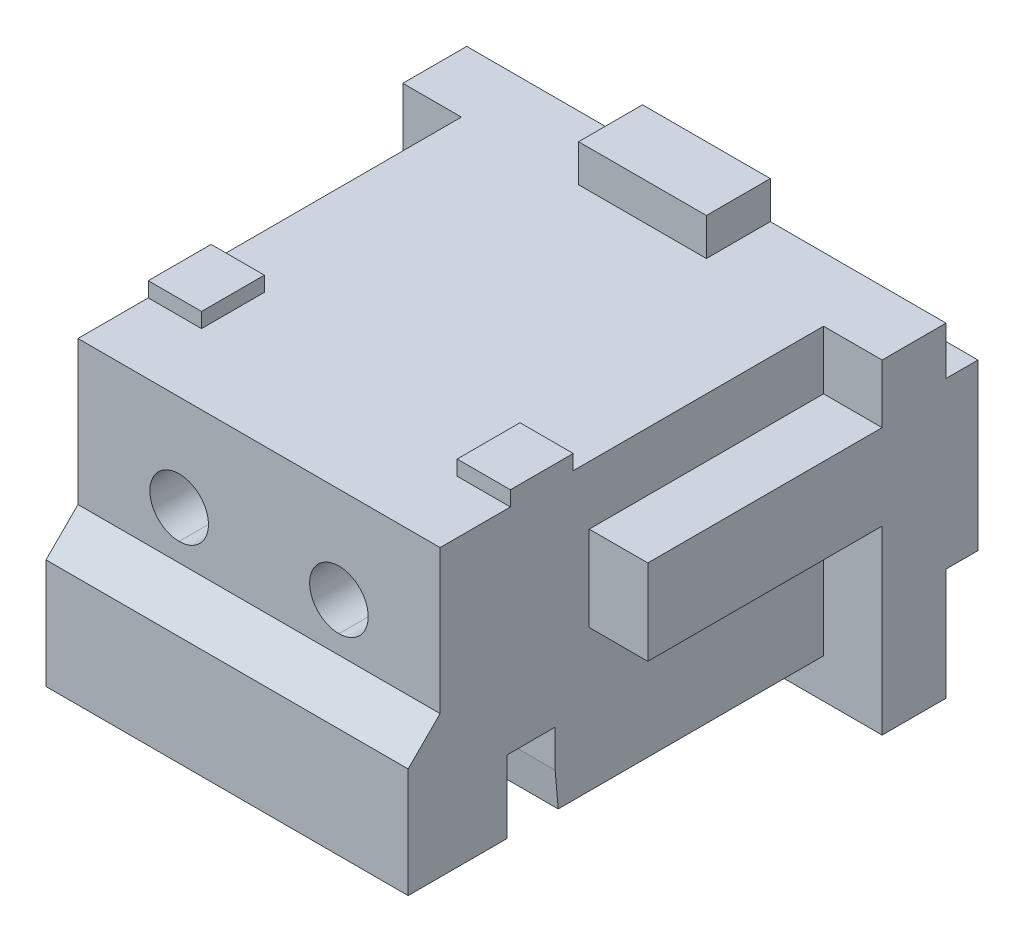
ISO-10303-21;
HEADER;
FILE_DESCRIPTION(('STEP AP214'),'2;1');
FILE_NAME('part.step','',(''),(''),'','','');
FILE_SCHEMA(('AUTOMOTIVE_DESIGN { 1 0 10303 214 1 1 1 1 }'));
ENDSEC;
DATA;
#1=APPLICATION_CONTEXT('core data for automotive mechanical design processes');
#2=APPLICATION_PROTOCOL_DEFINITION('international standard','automotive_design',2000,#1);
#3=PRODUCT_CONTEXT('',#1,'mechanical');
#4=PRODUCT('Part','Part','',(#3));
#5=PRODUCT_RELATED_PRODUCT_CATEGORY('part','',(#4));
#6=PRODUCT_DEFINITION_FORMATION('','',#4);
#7=PRODUCT_DEFINITION_CONTEXT('part definition',#1,'design');
#8=PRODUCT_DEFINITION('design','',#6,#7);
#9=PRODUCT_DEFINITION_SHAPE('','',#8);
#10=(LENGTH_UNIT() NAMED_UNIT(*) SI_UNIT(.MILLI.,.METRE.));
#11=(NAMED_UNIT(*) PLANE_ANGLE_UNIT() SI_UNIT($,.RADIAN.));
#12=(NAMED_UNIT(*) SI_UNIT($,.STERADIAN.) SOLID_ANGLE_UNIT());
#13=UNCERTAINTY_MEASURE_WITH_UNIT(LENGTH_MEASURE(1.E-05),#10,'distance_accuracy_value','');
#14=(GEOMETRIC_REPRESENTATION_CONTEXT(3) GLOBAL_UNCERTAINTY_ASSIGNED_CONTEXT((#13)) GLOBAL_UNIT_ASSIGNED_CONTEXT((#10,
#11,#12)) REPRESENTATION_CONTEXT('',''));
#15=CARTESIAN_POINT('',(0.,0.,0.));
#16=DIRECTION('',(0.,0.,1.));
#17=DIRECTION('',(1.,0.,0.));
#18=AXIS2_PLACEMENT_3D('',#15,#16,#17);
#19=CARTESIAN_POINT('',(-0.750000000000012,2.55,2.15));
#20=DIRECTION('',(0.,0.,1.));
#21=DIRECTION('',(0.,-1.,0.));
#22=AXIS2_PLACEMENT_3D('',#19,#20,#21);
#23=PLANE('',#22);
#24=CARTESIAN_POINT('',(-0.750000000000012,2.55,2.15));
#25=DIRECTION('',(0.,0.,1.));
#26=DIRECTION('',(0.,1.,0.));
#27=AXIS2_PLACEMENT_3D('',#24,#25,#26);
#28=CIRCLE('',#27,0.275);
#29=CARTESIAN_POINT('',(-0.750000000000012,2.825,2.15));
#30=VERTEX_POINT('',#29);
#31=CARTESIAN_POINT('',(-0.750000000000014,2.275,2.15));
#32=VERTEX_POINT('',#31);
#33=EDGE_CURVE('E797',#30,#32,#28,.T.);
#34=ORIENTED_EDGE('',*,*,#33,.T.);
#35=CARTESIAN_POINT('',(-0.750000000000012,2.55,2.15));
#36=DIRECTION('',(0.,0.,1.));
#37=DIRECTION('',(0.,1.,0.));
#38=AXIS2_PLACEMENT_3D('',#35,#36,#37);
#39=CIRCLE('',#38,0.275);
#40=EDGE_CURVE('E27',#32,#30,#39,.T.);
#41=ORIENTED_EDGE('',*,*,#40,.T.);
#42=EDGE_LOOP('',(#34,#41));
#43=FACE_BOUND('',#42,.T.);
#44=ADVANCED_FACE('F18',(#43),#23,.T.);
#45=CARTESIAN_POINT('',(0.749999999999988,2.55,2.15));
#46=DIRECTION('',(0.,0.,1.));
#47=DIRECTION('',(0.,-1.,0.));
#48=AXIS2_PLACEMENT_3D('',#45,#46,#47);
#49=PLANE('',#48);
#50=CARTESIAN_POINT('',(0.749999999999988,2.55,2.15));
#51=DIRECTION('',(0.,0.,1.));
#52=DIRECTION('',(0.,1.,0.));
#53=AXIS2_PLACEMENT_3D('',#50,#51,#52);
#54=CIRCLE('',#53,0.275);
#55=CARTESIAN_POINT('',(0.749999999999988,2.825,2.15));
#56=VERTEX_POINT('',#55);
#57=CARTESIAN_POINT('',(0.749999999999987,2.275,2.15));
#58=VERTEX_POINT('',#57);
#59=EDGE_CURVE('E11',#56,#58,#54,.T.);
#60=ORIENTED_EDGE('',*,*,#59,.T.);
#61=CARTESIAN_POINT('',(0.749999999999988,2.55,2.15));
#62=DIRECTION('',(0.,0.,1.));
#63=DIRECTION('',(0.,1.,0.));
#64=AXIS2_PLACEMENT_3D('',#61,#62,#63);
#65=CIRCLE('',#64,0.275);
#66=EDGE_CURVE('E807',#58,#56,#65,.T.);
#67=ORIENTED_EDGE('',*,*,#66,.T.);
#68=EDGE_LOOP('',(#60,#67));
#69=FACE_BOUND('',#68,.T.);
#70=ADVANCED_FACE('F2383',(#69),#49,.T.);
#71=CARTESIAN_POINT('',(0.749999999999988,2.55,2.15));
#72=DIRECTION('',(0.,0.,1.));
#73=DIRECTION('',(0.,1.,0.));
#74=AXIS2_PLACEMENT_3D('',#71,#72,#73);
#75=CYLINDRICAL_SURFACE('',#74,0.275);
#76=DIRECTION('',(0.,0.,1.));
#77=VECTOR('',#76,1.);
#78=CARTESIAN_POINT('',(0.749999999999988,2.275,2.15));
#79=LINE('',#78,#77);
#80=CARTESIAN_POINT('',(0.749999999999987,2.275,2.55));
#81=VERTEX_POINT('',#80);
#82=EDGE_CURVE('E810',#58,#81,#79,.T.);
#83=ORIENTED_EDGE('',*,*,#82,.F.);
#84=ORIENTED_EDGE('',*,*,#59,.F.);
#85=DIRECTION('',(0.,0.,1.));
#86=VECTOR('',#85,1.);
#87=CARTESIAN_POINT('',(0.749999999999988,2.825,2.15));
#88=LINE('',#87,#86);
#89=CARTESIAN_POINT('',(0.749999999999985,2.825,2.55));
#90=VERTEX_POINT('',#89);
#91=EDGE_CURVE('E813',#56,#90,#88,.T.);
#92=ORIENTED_EDGE('',*,*,#91,.T.);
#93=CARTESIAN_POINT('',(0.749999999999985,2.55,2.55));
#94=DIRECTION('',(0.,0.,1.));
#95=DIRECTION('',(0.,1.,0.));
#96=AXIS2_PLACEMENT_3D('',#93,#94,#95);
#97=CIRCLE('',#96,0.275);
#98=EDGE_CURVE('E752',#90,#81,#97,.T.);
#99=ORIENTED_EDGE('',*,*,#98,.T.);
#100=EDGE_LOOP('',(#83,#84,#92,#99));
#101=FACE_BOUND('',#100,.T.);
#102=ADVANCED_FACE('F2378',(#101),#75,.F.);
#103=CARTESIAN_POINT('',(-0.750000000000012,2.55,2.15));
#104=DIRECTION('',(0.,0.,1.));
#105=DIRECTION('',(0.,1.,0.));
#106=AXIS2_PLACEMENT_3D('',#103,#104,#105);
#107=CYLINDRICAL_SURFACE('',#106,0.275);
#108=ORIENTED_EDGE('',*,*,#40,.F.);
#109=DIRECTION('',(0.,0.,1.));
#110=VECTOR('',#109,1.);
#111=CARTESIAN_POINT('',(-0.750000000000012,2.275,2.15));
#112=LINE('',#111,#110);
#113=CARTESIAN_POINT('',(-0.750000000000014,2.275,2.55));
#114=VERTEX_POINT('',#113);
#115=EDGE_CURVE('E801',#32,#114,#112,.T.);
#116=ORIENTED_EDGE('',*,*,#115,.T.);
#117=CARTESIAN_POINT('',(-0.750000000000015,2.55,2.55));
#118=DIRECTION('',(0.,0.,1.));
#119=DIRECTION('',(0.,1.,0.));
#120=AXIS2_PLACEMENT_3D('',#117,#118,#119);
#121=CIRCLE('',#120,0.275);
#122=CARTESIAN_POINT('',(-0.750000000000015,2.825,2.55));
#123=VERTEX_POINT('',#122);
#124=EDGE_CURVE('E748',#114,#123,#121,.T.);
#125=ORIENTED_EDGE('',*,*,#124,.T.);
#126=DIRECTION('',(0.,0.,1.));
#127=VECTOR('',#126,1.);
#128=CARTESIAN_POINT('',(-0.750000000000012,2.825,2.15));
#129=LINE('',#128,#127);
#130=EDGE_CURVE('E800',#30,#123,#129,.T.);
#131=ORIENTED_EDGE('',*,*,#130,.F.);
#132=EDGE_LOOP('',(#108,#116,#125,#131));
#133=FACE_BOUND('',#132,.T.);
#134=ADVANCED_FACE('F2382',(#133),#107,.F.);
#135=CARTESIAN_POINT('',(-0.750000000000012,2.55,2.15));
#136=DIRECTION('',(0.,0.,1.));
#137=DIRECTION('',(0.,1.,0.));
#138=AXIS2_PLACEMENT_3D('',#135,#136,#137);
#139=CYLINDRICAL_SURFACE('',#138,0.275);
#140=ORIENTED_EDGE('',*,*,#115,.F.);
#141=ORIENTED_EDGE('',*,*,#33,.F.);
#142=ORIENTED_EDGE('',*,*,#130,.T.);
#143=CARTESIAN_POINT('',(-0.750000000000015,2.55,2.55));
#144=DIRECTION('',(0.,0.,1.));
#145=DIRECTION('',(0.,1.,0.));
#146=AXIS2_PLACEMENT_3D('',#143,#144,#145);
#147=CIRCLE('',#146,0.275);
#148=EDGE_CURVE('E744',#123,#114,#147,.T.);
#149=ORIENTED_EDGE('',*,*,#148,.T.);
#150=EDGE_LOOP('',(#140,#141,#142,#149));
#151=FACE_BOUND('',#150,.T.);
#152=ADVANCED_FACE('F2761',(#151),#139,.F.);
#153=CARTESIAN_POINT('',(0.749999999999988,2.55,2.15));
#154=DIRECTION('',(0.,0.,1.));
#155=DIRECTION('',(0.,1.,0.));
#156=AXIS2_PLACEMENT_3D('',#153,#154,#155);
#157=CYLINDRICAL_SURFACE('',#156,0.275);
#158=ORIENTED_EDGE('',*,*,#66,.F.);
#159=ORIENTED_EDGE('',*,*,#82,.T.);
#160=CARTESIAN_POINT('',(0.749999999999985,2.55,2.55));
#161=DIRECTION('',(0.,0.,1.));
#162=DIRECTION('',(0.,1.,0.));
#163=AXIS2_PLACEMENT_3D('',#160,#161,#162);
#164=CIRCLE('',#163,0.275);
#165=EDGE_CURVE('E756',#81,#90,#164,.T.);
#166=ORIENTED_EDGE('',*,*,#165,.T.);
#167=ORIENTED_EDGE('',*,*,#91,.F.);
#168=EDGE_LOOP('',(#158,#159,#166,#167));
#169=FACE_BOUND('',#168,.T.);
#170=ADVANCED_FACE('F2741',(#169),#157,.F.);
#171=CARTESIAN_POINT('',(-1.2,3.59,1.89));
#172=DIRECTION('',(0.,1.,0.));
#173=DIRECTION('',(0.,0.,-1.));
#174=AXIS2_PLACEMENT_3D('',#171,#172,#173);
#175=PLANE('',#174);
#176=DIRECTION('',(0.,0.,-1.));
#177=VECTOR('',#176,1.);
#178=CARTESIAN_POINT('',(-1.7,3.59,1.89));
#179=LINE('',#178,#177);
#180=CARTESIAN_POINT('',(-1.7,3.59,1.89));
#181=VERTEX_POINT('',#180);
#182=CARTESIAN_POINT('',(-1.7,3.59,1.3));
#183=VERTEX_POINT('',#182);
#184=EDGE_CURVE('E732',#181,#183,#179,.T.);
#185=ORIENTED_EDGE('',*,*,#184,.F.);
#186=DIRECTION('',(-1.,0.,0.));
#187=VECTOR('',#186,1.);
#188=CARTESIAN_POINT('',(-1.2,3.59,1.89));
#189=LINE('',#188,#187);
#190=CARTESIAN_POINT('',(-1.2,3.59,1.89));
#191=VERTEX_POINT('',#190);
#192=EDGE_CURVE('E500',#191,#181,#189,.T.);
#193=ORIENTED_EDGE('',*,*,#192,.F.);
#194=DIRECTION('',(0.,0.,-1.));
#195=VECTOR('',#194,1.);
#196=CARTESIAN_POINT('',(-1.2,3.59,1.89));
#197=LINE('',#196,#195);
#198=CARTESIAN_POINT('',(-1.2,3.59,1.3));
#199=VERTEX_POINT('',#198);
#200=EDGE_CURVE('E763',#191,#199,#197,.T.);
#201=ORIENTED_EDGE('',*,*,#200,.T.);
#202=DIRECTION('',(-1.,0.,0.));
#203=VECTOR('',#202,1.);
#204=CARTESIAN_POINT('',(-1.2,3.59,1.3));
#205=LINE('',#204,#203);
#206=EDGE_CURVE('E779',#199,#183,#205,.T.);
#207=ORIENTED_EDGE('',*,*,#206,.T.);
#208=EDGE_LOOP('',(#185,#193,#201,#207));
#209=FACE_BOUND('',#208,.T.);
#210=ADVANCED_FACE('F2737',(#209),#175,.T.);
#211=CARTESIAN_POINT('',(1.2,3.59,1.89000000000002));
#212=DIRECTION('',(0.,-1.,0.));
#213=DIRECTION('',(0.,0.,-1.));
#214=AXIS2_PLACEMENT_3D('',#211,#212,#213);
#215=PLANE('',#214);
#216=DIRECTION('',(0.,0.,-1.));
#217=VECTOR('',#216,1.);
#218=CARTESIAN_POINT('',(1.7,3.59,1.89000000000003));
#219=LINE('',#218,#217);
#220=CARTESIAN_POINT('',(1.7,3.59,1.89000000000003));
#221=VERTEX_POINT('',#220);
#222=CARTESIAN_POINT('',(1.7,3.59,1.30000000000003));
#223=VERTEX_POINT('',#222);
#224=EDGE_CURVE('E698',#221,#223,#219,.T.);
#225=ORIENTED_EDGE('',*,*,#224,.T.);
#226=DIRECTION('',(1.,0.,0.));
#227=VECTOR('',#226,1.);
#228=CARTESIAN_POINT('',(1.2,3.59,1.30000000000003));
#229=LINE('',#228,#227);
#230=CARTESIAN_POINT('',(1.2,3.59,1.30000000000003));
#231=VERTEX_POINT('',#230);
#232=EDGE_CURVE('E127',#231,#223,#229,.T.);
#233=ORIENTED_EDGE('',*,*,#232,.F.);
#234=DIRECTION('',(0.,0.,-1.));
#235=VECTOR('',#234,1.);
#236=CARTESIAN_POINT('',(1.2,3.59,1.89000000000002));
#237=LINE('',#236,#235);
#238=CARTESIAN_POINT('',(1.2,3.59,1.89000000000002));
#239=VERTEX_POINT('',#238);
#240=EDGE_CURVE('E772',#239,#231,#237,.T.);
#241=ORIENTED_EDGE('',*,*,#240,.F.);
#242=DIRECTION('',(1.,0.,0.));
#243=VECTOR('',#242,1.);
#244=CARTESIAN_POINT('',(1.2,3.59,1.89000000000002));
#245=LINE('',#244,#243);
#246=EDGE_CURVE('E229',#239,#221,#245,.T.);
#247=ORIENTED_EDGE('',*,*,#246,.T.);
#248=EDGE_LOOP('',(#225,#233,#241,#247));
#249=FACE_BOUND('',#248,.T.);
#250=ADVANCED_FACE('F2165',(#249),#215,.F.);
#251=CARTESIAN_POINT('',(-2.25,2.1,2.55));
#252=DIRECTION('',(0.,-0.707106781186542,-0.707106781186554));
#253=DIRECTION('',(0.,-0.707106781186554,0.707106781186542));
#254=AXIS2_PLACEMENT_3D('',#251,#252,#253);
#255=PLANE('',#254);
#256=DIRECTION('',(0.,0.707106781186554,-0.707106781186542));
#257=VECTOR('',#256,1.);
#258=CARTESIAN_POINT('',(1.7,1.79999999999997,2.85));
#259=LINE('',#258,#257);
#260=CARTESIAN_POINT('',(1.7,1.79999999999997,2.85));
#261=VERTEX_POINT('',#260);
#262=CARTESIAN_POINT('',(1.7,2.1,2.55));
#263=VERTEX_POINT('',#262);
#264=EDGE_CURVE('E513',#261,#263,#259,.T.);
#265=ORIENTED_EDGE('',*,*,#264,.T.);
#266=DIRECTION('',(1.,0.,0.));
#267=VECTOR('',#266,1.);
#268=CARTESIAN_POINT('',(-2.25,2.1,2.55));
#269=LINE('',#268,#267);
#270=CARTESIAN_POINT('',(-1.7,2.1,2.55));
#271=VERTEX_POINT('',#270);
#272=EDGE_CURVE('E219',#271,#263,#269,.T.);
#273=ORIENTED_EDGE('',*,*,#272,.F.);
#274=DIRECTION('',(0.,0.707106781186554,-0.707106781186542));
#275=VECTOR('',#274,1.);
#276=CARTESIAN_POINT('',(-1.7,1.79999999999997,2.85));
#277=LINE('',#276,#275);
#278=CARTESIAN_POINT('',(-1.7,1.79999999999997,2.85));
#279=VERTEX_POINT('',#278);
#280=EDGE_CURVE('E721',#279,#271,#277,.T.);
#281=ORIENTED_EDGE('',*,*,#280,.F.);
#282=DIRECTION('',(1.,0.,0.));
#283=VECTOR('',#282,1.);
#284=CARTESIAN_POINT('',(-2.25,1.79999999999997,2.85));
#285=LINE('',#284,#283);
#286=EDGE_CURVE('E790',#279,#261,#285,.T.);
#287=ORIENTED_EDGE('',*,*,#286,.T.);
#288=EDGE_LOOP('',(#265,#273,#281,#287));
#289=FACE_BOUND('',#288,.T.);
#290=ADVANCED_FACE('F2160',(#289),#255,.F.);
#291=CARTESIAN_POINT('',(-2.25,0.769999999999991,1.44109999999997));
#292=DIRECTION('',(0.,-0.087155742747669,0.996194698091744));
#293=DIRECTION('',(-1.,0.,0.));
#294=AXIS2_PLACEMENT_3D('',#291,#292,#293);
#295=PLANE('',#294);
#296=DIRECTION('',(1.,0.,0.));
#297=VECTOR('',#296,1.);
#298=CARTESIAN_POINT('',(-2.25,0.769999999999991,1.44109999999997));
#299=LINE('',#298,#297);
#300=CARTESIAN_POINT('',(-1.7,0.769999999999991,1.44109999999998));
#301=VERTEX_POINT('',#300);
#302=CARTESIAN_POINT('',(1.7,0.769999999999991,1.4411));
#303=VERTEX_POINT('',#302);
#304=EDGE_CURVE('E590',#301,#303,#299,.T.);
#305=ORIENTED_EDGE('',*,*,#304,.T.);
#306=DIRECTION('',(0.,0.996194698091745,0.087155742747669));
#307=VECTOR('',#306,1.);
#308=CARTESIAN_POINT('',(1.7,0.769999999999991,1.4411));
#309=LINE('',#308,#307);
#310=CARTESIAN_POINT('',(1.7,1.1,1.46997125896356));
#311=VERTEX_POINT('',#310);
#312=EDGE_CURVE('E492',#303,#311,#309,.T.);
#313=ORIENTED_EDGE('',*,*,#312,.T.);
#314=DIRECTION('',(1.,0.,0.));
#315=VECTOR('',#314,1.);
#316=CARTESIAN_POINT('',(-2.25,1.1,1.46997125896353));
#317=LINE('',#316,#315);
#318=CARTESIAN_POINT('',(-1.7,1.1,1.46997125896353));
#319=VERTEX_POINT('',#318);
#320=EDGE_CURVE('E804',#319,#311,#317,.T.);
#321=ORIENTED_EDGE('',*,*,#320,.F.);
#322=DIRECTION('',(0.,0.996194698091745,0.087155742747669));
#323=VECTOR('',#322,1.);
#324=CARTESIAN_POINT('',(-1.7,3.2133549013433,1.65486585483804));
#325=LINE('',#324,#323);
#326=EDGE_CURVE('E741',#301,#319,#325,.T.);
#327=ORIENTED_EDGE('',*,*,#326,.F.);
#328=EDGE_LOOP('',(#305,#313,#321,#327));
#329=FACE_BOUND('',#328,.T.);
#330=ADVANCED_FACE('F2164',(#329),#295,.T.);
#331=CARTESIAN_POINT('',(-2.25,1.1,1.46997125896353));
#332=DIRECTION('',(0.,0.,1.));
#333=DIRECTION('',(0.,-1.,0.));
#334=AXIS2_PLACEMENT_3D('',#331,#332,#333);
#335=PLANE('',#334);
#336=ORIENTED_EDGE('',*,*,#320,.T.);
#337=DIRECTION('',(0.,1.,0.));
#338=VECTOR('',#337,1.);
#339=CARTESIAN_POINT('',(1.7,1.1,1.46997125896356));
#340=LINE('',#339,#338);
#341=CARTESIAN_POINT('',(1.7,1.45,1.46997125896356));
#342=VERTEX_POINT('',#341);
#343=EDGE_CURVE('E497',#311,#342,#340,.T.);
#344=ORIENTED_EDGE('',*,*,#343,.T.);
#345=DIRECTION('',(1.,0.,0.));
#346=VECTOR('',#345,1.);
#347=CARTESIAN_POINT('',(-2.25,1.45,1.46997125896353));
#348=LINE('',#347,#346);
#349=CARTESIAN_POINT('',(-1.7,1.45,1.46997125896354));
#350=VERTEX_POINT('',#349);
#351=EDGE_CURVE('E784',#350,#342,#348,.T.);
#352=ORIENTED_EDGE('',*,*,#351,.F.);
#353=DIRECTION('',(0.,1.,0.));
#354=VECTOR('',#353,1.);
#355=CARTESIAN_POINT('',(-1.7,3.45,1.46997125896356));
#356=LINE('',#355,#354);
#357=EDGE_CURVE('E737',#319,#350,#356,.T.);
#358=ORIENTED_EDGE('',*,*,#357,.F.);
#359=EDGE_LOOP('',(#336,#344,#352,#358));
#360=FACE_BOUND('',#359,.T.);
#361=ADVANCED_FACE('F2543',(#360),#335,.T.);
#362=CARTESIAN_POINT('',(-2.25,0.769999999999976,2.85));
#363=DIRECTION('',(0.,1.,0.));
#364=DIRECTION('',(0.,0.,-1.));
#365=AXIS2_PLACEMENT_3D('',#362,#363,#364);
#366=PLANE('',#365);
#367=DIRECTION('',(0.,0.,1.));
#368=VECTOR('',#367,1.);
#369=CARTESIAN_POINT('',(1.7,0.769999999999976,2.85));
#370=LINE('',#369,#368);
#371=CARTESIAN_POINT('',(1.7,0.769999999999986,1.91997125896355));
#372=VERTEX_POINT('',#371);
#373=CARTESIAN_POINT('',(1.7,0.769999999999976,2.85));
#374=VERTEX_POINT('',#373);
#375=EDGE_CURVE('E642',#372,#374,#370,.T.);
#376=ORIENTED_EDGE('',*,*,#375,.T.);
#377=DIRECTION('',(1.,0.,0.));
#378=VECTOR('',#377,1.);
#379=CARTESIAN_POINT('',(-2.25,0.769999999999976,2.85));
#380=LINE('',#379,#378);
#381=CARTESIAN_POINT('',(-1.7,0.769999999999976,2.85));
#382=VERTEX_POINT('',#381);
#383=EDGE_CURVE('E793',#382,#374,#380,.T.);
#384=ORIENTED_EDGE('',*,*,#383,.F.);
#385=DIRECTION('',(0.,0.,1.));
#386=VECTOR('',#385,1.);
#387=CARTESIAN_POINT('',(-1.7,0.769999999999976,2.85));
#388=LINE('',#387,#386);
#389=CARTESIAN_POINT('',(-1.7,0.769999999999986,1.91997125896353));
#390=VERTEX_POINT('',#389);
#391=EDGE_CURVE('E713',#390,#382,#388,.T.);
#392=ORIENTED_EDGE('',*,*,#391,.F.);
#393=DIRECTION('',(1.,0.,0.));
#394=VECTOR('',#393,1.);
#395=CARTESIAN_POINT('',(-2.25,0.769999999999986,1.91997125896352));
#396=LINE('',#395,#394);
#397=EDGE_CURVE('E796',#390,#372,#396,.T.);
#398=ORIENTED_EDGE('',*,*,#397,.T.);
#399=EDGE_LOOP('',(#376,#384,#392,#398));
#400=FACE_BOUND('',#399,.T.);
#401=ADVANCED_FACE('F2547',(#400),#366,.F.);
#402=CARTESIAN_POINT('',(-2.25,1.44999999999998,1.91997125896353));
#403=DIRECTION('',(0.,0.,-1.));
#404=DIRECTION('',(-1.,0.,0.));
#405=AXIS2_PLACEMENT_3D('',#402,#403,#404);
#406=PLANE('',#405);
#407=DIRECTION('',(1.,0.,0.));
#408=VECTOR('',#407,1.);
#409=CARTESIAN_POINT('',(-2.25,1.44999999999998,1.91997125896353));
#410=LINE('',#409,#408);
#411=CARTESIAN_POINT('',(-1.7,1.44999999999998,1.91997125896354));
#412=VERTEX_POINT('',#411);
#413=CARTESIAN_POINT('',(1.7,1.44999999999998,1.91997125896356));
#414=VERTEX_POINT('',#413);
#415=EDGE_CURVE('E787',#412,#414,#410,.T.);
#416=ORIENTED_EDGE('',*,*,#415,.T.);
#417=DIRECTION('',(0.,-1.,0.));
#418=VECTOR('',#417,1.);
#419=CARTESIAN_POINT('',(1.7,1.44999999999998,1.91997125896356));
#420=LINE('',#419,#418);
#421=EDGE_CURVE('E702',#414,#372,#420,.T.);
#422=ORIENTED_EDGE('',*,*,#421,.T.);
#423=ORIENTED_EDGE('',*,*,#397,.F.);
#424=DIRECTION('',(0.,-1.,0.));
#425=VECTOR('',#424,1.);
#426=CARTESIAN_POINT('',(-1.7,3.45,1.91997125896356));
#427=LINE('',#426,#425);
#428=EDGE_CURVE('E709',#412,#390,#427,.T.);
#429=ORIENTED_EDGE('',*,*,#428,.F.);
#430=EDGE_LOOP('',(#416,#422,#423,#429));
#431=FACE_BOUND('',#430,.T.);
#432=ADVANCED_FACE('F2717',(#431),#406,.T.);
#433=CARTESIAN_POINT('',(-2.25,1.79999999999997,2.85));
#434=DIRECTION('',(0.,0.,-1.));
#435=DIRECTION('',(-1.,0.,0.));
#436=AXIS2_PLACEMENT_3D('',#433,#434,#435);
#437=PLANE('',#436);
#438=DIRECTION('',(0.,1.,0.));
#439=VECTOR('',#438,1.);
#440=CARTESIAN_POINT('',(1.7,0.769999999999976,2.85));
#441=LINE('',#440,#439);
#442=EDGE_CURVE('E638',#374,#261,#441,.T.);
#443=ORIENTED_EDGE('',*,*,#442,.T.);
#444=ORIENTED_EDGE('',*,*,#286,.F.);
#445=DIRECTION('',(0.,1.,0.));
#446=VECTOR('',#445,1.);
#447=CARTESIAN_POINT('',(-1.7,0.769999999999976,2.85));
#448=LINE('',#447,#446);
#449=EDGE_CURVE('E717',#382,#279,#448,.T.);
#450=ORIENTED_EDGE('',*,*,#449,.F.);
#451=ORIENTED_EDGE('',*,*,#383,.T.);
#452=EDGE_LOOP('',(#443,#444,#450,#451));
#453=FACE_BOUND('',#452,.T.);
#454=ADVANCED_FACE('F2705',(#453),#437,.F.);
#455=CARTESIAN_POINT('',(-2.25,1.45,1.46997125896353));
#456=DIRECTION('',(0.,-1.,0.));
#457=DIRECTION('',(0.,0.,-1.));
#458=AXIS2_PLACEMENT_3D('',#455,#456,#457);
#459=PLANE('',#458);
#460=ORIENTED_EDGE('',*,*,#351,.T.);
#461=DIRECTION('',(0.,0.,1.));
#462=VECTOR('',#461,1.);
#463=CARTESIAN_POINT('',(1.7,1.45,1.46997125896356));
#464=LINE('',#463,#462);
#465=EDGE_CURVE('E447',#342,#414,#464,.T.);
#466=ORIENTED_EDGE('',*,*,#465,.T.);
#467=ORIENTED_EDGE('',*,*,#415,.F.);
#468=DIRECTION('',(0.,0.,1.));
#469=VECTOR('',#468,1.);
#470=CARTESIAN_POINT('',(-1.7,1.45000000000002,-1.05000000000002));
#471=LINE('',#470,#469);
#472=EDGE_CURVE('E589',#350,#412,#471,.T.);
#473=ORIENTED_EDGE('',*,*,#472,.F.);
#474=EDGE_LOOP('',(#460,#466,#467,#473));
#475=FACE_BOUND('',#474,.T.);
#476=ADVANCED_FACE('F2694',(#475),#459,.T.);
#477=CARTESIAN_POINT('',(-2.25,3.8,-1.05));
#478=DIRECTION('',(0.,0.,-1.));
#479=DIRECTION('',(-1.,0.,0.));
#480=AXIS2_PLACEMENT_3D('',#477,#478,#479);
#481=PLANE('',#480);
#482=DIRECTION('',(0.,1.,0.));
#483=VECTOR('',#482,1.);
#484=CARTESIAN_POINT('',(0.60000000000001,3.45,-1.04999999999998));
#485=LINE('',#484,#483);
#486=CARTESIAN_POINT('',(0.60000000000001,3.45,-1.04999999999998));
#487=VERTEX_POINT('',#486);
#488=CARTESIAN_POINT('',(0.60000000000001,3.8,-1.04999999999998));
#489=VERTEX_POINT('',#488);
#490=EDGE_CURVE('E436',#487,#489,#485,.T.);
#491=ORIENTED_EDGE('',*,*,#490,.T.);
#492=DIRECTION('',(1.,0.,0.));
#493=VECTOR('',#492,1.);
#494=CARTESIAN_POINT('',(-2.25,3.8,-1.05));
#495=LINE('',#494,#493);
#496=CARTESIAN_POINT('',(-0.599999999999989,3.8,-1.04999999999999));
#497=VERTEX_POINT('',#496);
#498=EDGE_CURVE('E448',#497,#489,#495,.T.);
#499=ORIENTED_EDGE('',*,*,#498,.F.);
#500=DIRECTION('',(0.,1.,0.));
#501=VECTOR('',#500,1.);
#502=CARTESIAN_POINT('',(-0.599999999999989,3.45,-1.05));
#503=LINE('',#502,#501);
#504=CARTESIAN_POINT('',(-0.599999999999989,3.45,-1.05));
#505=VERTEX_POINT('',#504);
#506=EDGE_CURVE('E454',#505,#497,#503,.T.);
#507=ORIENTED_EDGE('',*,*,#506,.F.);
#508=DIRECTION('',(1.,0.,0.));
#509=VECTOR('',#508,1.);
#510=CARTESIAN_POINT('',(-2.25,3.45,-1.05));
#511=LINE('',#510,#509);
#512=EDGE_CURVE('E451',#505,#487,#511,.T.);
#513=ORIENTED_EDGE('',*,*,#512,.T.);
#514=EDGE_LOOP('',(#491,#499,#507,#513));
#515=FACE_BOUND('',#514,.T.);
#516=ADVANCED_FACE('F452',(#515),#481,.F.);
#517=CARTESIAN_POINT('',(1.2,3.45,1.30000000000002));
#518=DIRECTION('',(0.,0.,1.));
#519=DIRECTION('',(0.,-1.,0.));
#520=AXIS2_PLACEMENT_3D('',#517,#518,#519);
#521=PLANE('',#520);
#522=DIRECTION('',(0.,-1.,0.));
#523=VECTOR('',#522,1.);
#524=CARTESIAN_POINT('',(1.7,3.45,1.30000000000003));
#525=LINE('',#524,#523);
#526=CARTESIAN_POINT('',(1.7,3.45,1.30000000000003));
#527=VERTEX_POINT('',#526);
#528=EDGE_CURVE('E695',#223,#527,#525,.T.);
#529=ORIENTED_EDGE('',*,*,#528,.T.);
#530=DIRECTION('',(1.,0.,0.));
#531=VECTOR('',#530,1.);
#532=CARTESIAN_POINT('',(1.2,3.45,1.30000000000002));
#533=LINE('',#532,#531);
#534=CARTESIAN_POINT('',(1.2,3.45,1.30000000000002));
#535=VERTEX_POINT('',#534);
#536=EDGE_CURVE('E471',#535,#527,#533,.T.);
#537=ORIENTED_EDGE('',*,*,#536,.F.);
#538=DIRECTION('',(0.,-1.,0.));
#539=VECTOR('',#538,1.);
#540=CARTESIAN_POINT('',(1.2,3.45,1.30000000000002));
#541=LINE('',#540,#539);
#542=EDGE_CURVE('E776',#231,#535,#541,.T.);
#543=ORIENTED_EDGE('',*,*,#542,.F.);
#544=ORIENTED_EDGE('',*,*,#232,.T.);
#545=EDGE_LOOP('',(#529,#537,#543,#544));
#546=FACE_BOUND('',#545,.T.);
#547=ADVANCED_FACE('F2174',(#546),#521,.F.);
#548=CARTESIAN_POINT('',(1.2,3.45,1.89000000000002));
#549=DIRECTION('',(0.,0.,-1.));
#550=DIRECTION('',(-1.,0.,0.));
#551=AXIS2_PLACEMENT_3D('',#548,#549,#550);
#552=PLANE('',#551);
#553=DIRECTION('',(0.,1.,0.));
#554=VECTOR('',#553,1.);
#555=CARTESIAN_POINT('',(1.7,3.45,1.89000000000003));
#556=LINE('',#555,#554);
#557=CARTESIAN_POINT('',(1.7,3.45,1.89000000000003));
#558=VERTEX_POINT('',#557);
#559=EDGE_CURVE('E514',#558,#221,#556,.T.);
#560=ORIENTED_EDGE('',*,*,#559,.T.);
#561=ORIENTED_EDGE('',*,*,#246,.F.);
#562=DIRECTION('',(0.,1.,0.));
#563=VECTOR('',#562,1.);
#564=CARTESIAN_POINT('',(1.2,3.45,1.89000000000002));
#565=LINE('',#564,#563);
#566=CARTESIAN_POINT('',(1.2,3.45,1.89000000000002));
#567=VERTEX_POINT('',#566);
#568=EDGE_CURVE('E768',#567,#239,#565,.T.);
#569=ORIENTED_EDGE('',*,*,#568,.F.);
#570=DIRECTION('',(1.,0.,0.));
#571=VECTOR('',#570,1.);
#572=CARTESIAN_POINT('',(1.2,3.45,1.89000000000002));
#573=LINE('',#572,#571);
#574=EDGE_CURVE('E659',#567,#558,#573,.T.);
#575=ORIENTED_EDGE('',*,*,#574,.T.);
#576=EDGE_LOOP('',(#560,#561,#569,#575));
#577=FACE_BOUND('',#576,.T.);
#578=ADVANCED_FACE('F2178',(#577),#552,.F.);
#579=CARTESIAN_POINT('',(-1.2,3.45,1.89));
#580=DIRECTION('',(0.,0.,1.));
#581=DIRECTION('',(0.,-1.,0.));
#582=AXIS2_PLACEMENT_3D('',#579,#580,#581);
#583=PLANE('',#582);
#584=DIRECTION('',(0.,1.,0.));
#585=VECTOR('',#584,1.);
#586=CARTESIAN_POINT('',(-1.7,3.45,1.89));
#587=LINE('',#586,#585);
#588=CARTESIAN_POINT('',(-1.7,3.45,1.89));
#589=VERTEX_POINT('',#588);
#590=EDGE_CURVE('E728',#589,#181,#587,.T.);
#591=ORIENTED_EDGE('',*,*,#590,.F.);
#592=DIRECTION('',(-1.,0.,0.));
#593=VECTOR('',#592,1.);
#594=CARTESIAN_POINT('',(-1.2,3.45,1.89));
#595=LINE('',#594,#593);
#596=CARTESIAN_POINT('',(-1.2,3.45,1.89));
#597=VERTEX_POINT('',#596);
#598=EDGE_CURVE('E609',#597,#589,#595,.T.);
#599=ORIENTED_EDGE('',*,*,#598,.F.);
#600=DIRECTION('',(0.,1.,0.));
#601=VECTOR('',#600,1.);
#602=CARTESIAN_POINT('',(-1.2,3.45,1.89));
#603=LINE('',#602,#601);
#604=EDGE_CURVE('E767',#597,#191,#603,.T.);
#605=ORIENTED_EDGE('',*,*,#604,.T.);
#606=ORIENTED_EDGE('',*,*,#192,.T.);
#607=EDGE_LOOP('',(#591,#599,#605,#606));
#608=FACE_BOUND('',#607,.T.);
#609=ADVANCED_FACE('F2650',(#608),#583,.T.);
#610=CARTESIAN_POINT('',(-1.2,3.45,1.3));
#611=DIRECTION('',(0.,0.,-1.));
#612=DIRECTION('',(-1.,0.,0.));
#613=AXIS2_PLACEMENT_3D('',#610,#611,#612);
#614=PLANE('',#613);
#615=DIRECTION('',(0.,-1.,0.));
#616=VECTOR('',#615,1.);
#617=CARTESIAN_POINT('',(-1.7,3.45,1.3));
#618=LINE('',#617,#616);
#619=CARTESIAN_POINT('',(-1.7,3.45,1.3));
#620=VERTEX_POINT('',#619);
#621=EDGE_CURVE('E736',#183,#620,#618,.T.);
#622=ORIENTED_EDGE('',*,*,#621,.F.);
#623=ORIENTED_EDGE('',*,*,#206,.F.);
#624=DIRECTION('',(0.,-1.,0.));
#625=VECTOR('',#624,1.);
#626=CARTESIAN_POINT('',(-1.2,3.45,1.3));
#627=LINE('',#626,#625);
#628=CARTESIAN_POINT('',(-1.2,3.45,1.3));
#629=VERTEX_POINT('',#628);
#630=EDGE_CURVE('E760',#199,#629,#627,.T.);
#631=ORIENTED_EDGE('',*,*,#630,.T.);
#632=DIRECTION('',(-1.,0.,0.));
#633=VECTOR('',#632,1.);
#634=CARTESIAN_POINT('',(-1.2,3.45,1.3));
#635=LINE('',#634,#633);
#636=EDGE_CURVE('E669',#629,#620,#635,.T.);
#637=ORIENTED_EDGE('',*,*,#636,.T.);
#638=EDGE_LOOP('',(#622,#623,#631,#637));
#639=FACE_BOUND('',#638,.T.);
#640=ADVANCED_FACE('F2638',(#639),#614,.T.);
#641=CARTESIAN_POINT('',(1.2,3.45,1.30000000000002));
#642=DIRECTION('',(-1.,0.,0.));
#643=DIRECTION('',(0.,0.,1.));
#644=AXIS2_PLACEMENT_3D('',#641,#642,#643);
#645=PLANE('',#644);
#646=DIRECTION('',(0.,0.,1.));
#647=VECTOR('',#646,1.);
#648=CARTESIAN_POINT('',(1.2,3.45,1.89000000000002));
#649=LINE('',#648,#647);
#650=EDGE_CURVE('E548',#535,#567,#649,.T.);
#651=ORIENTED_EDGE('',*,*,#650,.T.);
#652=ORIENTED_EDGE('',*,*,#568,.T.);
#653=ORIENTED_EDGE('',*,*,#240,.T.);
#654=ORIENTED_EDGE('',*,*,#542,.T.);
#655=EDGE_LOOP('',(#651,#652,#653,#654));
#656=FACE_BOUND('',#655,.T.);
#657=ADVANCED_FACE('F2626',(#656),#645,.T.);
#658=CARTESIAN_POINT('',(-1.2,3.45,1.3));
#659=DIRECTION('',(1.,0.,0.));
#660=DIRECTION('',(0.,0.,1.));
#661=AXIS2_PLACEMENT_3D('',#658,#659,#660);
#662=PLANE('',#661);
#663=DIRECTION('',(0.,0.,1.));
#664=VECTOR('',#663,1.);
#665=CARTESIAN_POINT('',(-1.2,3.45,1.89));
#666=LINE('',#665,#664);
#667=EDGE_CURVE('E614',#629,#597,#666,.T.);
#668=ORIENTED_EDGE('',*,*,#667,.F.);
#669=ORIENTED_EDGE('',*,*,#630,.F.);
#670=ORIENTED_EDGE('',*,*,#200,.F.);
#671=ORIENTED_EDGE('',*,*,#604,.F.);
#672=EDGE_LOOP('',(#668,#669,#670,#671));
#673=FACE_BOUND('',#672,.T.);
#674=ADVANCED_FACE('F2614',(#673),#662,.T.);
#675=CARTESIAN_POINT('',(-2.25,3.45,2.55));
#676=DIRECTION('',(0.,0.,-1.));
#677=DIRECTION('',(-1.,0.,0.));
#678=AXIS2_PLACEMENT_3D('',#675,#676,#677);
#679=PLANE('',#678);
#680=ORIENTED_EDGE('',*,*,#98,.F.);
#681=ORIENTED_EDGE('',*,*,#165,.F.);
#682=EDGE_LOOP('',(#680,#681));
#683=FACE_BOUND('',#682,.T.);
#684=ORIENTED_EDGE('',*,*,#148,.F.);
#685=ORIENTED_EDGE('',*,*,#124,.F.);
#686=EDGE_LOOP('',(#684,#685));
#687=FACE_BOUND('',#686,.T.);
#688=DIRECTION('',(0.,1.,0.));
#689=VECTOR('',#688,1.);
#690=CARTESIAN_POINT('',(1.7,2.1,2.55));
#691=LINE('',#690,#689);
#692=CARTESIAN_POINT('',(1.7,3.45,2.55));
#693=VERTEX_POINT('',#692);
#694=EDGE_CURVE('E510',#263,#693,#691,.T.);
#695=ORIENTED_EDGE('',*,*,#694,.T.);
#696=DIRECTION('',(1.,0.,0.));
#697=VECTOR('',#696,1.);
#698=CARTESIAN_POINT('',(-2.25,3.45,2.55));
#699=LINE('',#698,#697);
#700=CARTESIAN_POINT('',(-1.7,3.45,2.55));
#701=VERTEX_POINT('',#700);
#702=EDGE_CURVE('E539',#701,#693,#699,.T.);
#703=ORIENTED_EDGE('',*,*,#702,.F.);
#704=DIRECTION('',(0.,1.,0.));
#705=VECTOR('',#704,1.);
#706=CARTESIAN_POINT('',(-1.7,2.1,2.55));
#707=LINE('',#706,#705);
#708=EDGE_CURVE('E725',#271,#701,#707,.T.);
#709=ORIENTED_EDGE('',*,*,#708,.F.);
#710=ORIENTED_EDGE('',*,*,#272,.T.);
#711=EDGE_LOOP('',(#695,#703,#709,#710));
#712=FACE_BOUND('',#711,.T.);
#713=ADVANCED_FACE('F2602',(#683,#687,#712),#679,.F.);
#714=CARTESIAN_POINT('',(-1.7,3.45,-1.05));
#715=DIRECTION('',(-1.,0.,0.));
#716=DIRECTION('',(0.,0.,1.));
#717=AXIS2_PLACEMENT_3D('',#714,#715,#716);
#718=PLANE('',#717);
#719=ORIENTED_EDGE('',*,*,#472,.T.);
#720=ORIENTED_EDGE('',*,*,#428,.T.);
#721=ORIENTED_EDGE('',*,*,#391,.T.);
#722=ORIENTED_EDGE('',*,*,#449,.T.);
#723=ORIENTED_EDGE('',*,*,#280,.T.);
#724=ORIENTED_EDGE('',*,*,#708,.T.);
#725=DIRECTION('',(0.,0.,-1.));
#726=VECTOR('',#725,1.);
#727=CARTESIAN_POINT('',(-1.7,3.45,2.55));
#728=LINE('',#727,#726);
#729=EDGE_CURVE('E613',#701,#589,#728,.T.);
#730=ORIENTED_EDGE('',*,*,#729,.T.);
#731=ORIENTED_EDGE('',*,*,#590,.T.);
#732=ORIENTED_EDGE('',*,*,#184,.T.);
#733=ORIENTED_EDGE('',*,*,#621,.T.);
#734=DIRECTION('',(0.,0.,-1.));
#735=VECTOR('',#734,1.);
#736=CARTESIAN_POINT('',(-1.7,3.45,2.55));
#737=LINE('',#736,#735);
#738=CARTESIAN_POINT('',(-1.7,3.45,-1.05));
#739=VERTEX_POINT('',#738);
#740=EDGE_CURVE('E1078',#620,#739,#737,.T.);
#741=ORIENTED_EDGE('',*,*,#740,.T.);
#742=DIRECTION('',(0.,-1.,0.));
#743=VECTOR('',#742,1.);
#744=CARTESIAN_POINT('',(-1.7,3.45,-1.05));
#745=LINE('',#744,#743);
#746=CARTESIAN_POINT('',(-1.7,2.9,-1.05));
#747=VERTEX_POINT('',#746);
#748=EDGE_CURVE('E487',#739,#747,#745,.T.);
#749=ORIENTED_EDGE('',*,*,#748,.T.);
#750=DIRECTION('',(0.,0.,1.));
#751=VECTOR('',#750,1.);
#752=CARTESIAN_POINT('',(-1.7,2.9,-1.05));
#753=LINE('',#752,#751);
#754=CARTESIAN_POINT('',(-1.7,2.9,1.15));
#755=VERTEX_POINT('',#754);
#756=EDGE_CURVE('E682',#747,#755,#753,.T.);
#757=ORIENTED_EDGE('',*,*,#756,.T.);
#758=DIRECTION('',(0.,-1.,0.));
#759=VECTOR('',#758,1.);
#760=CARTESIAN_POINT('',(-1.7,2.1,1.15));
#761=LINE('',#760,#759);
#762=CARTESIAN_POINT('',(-1.7,2.1,1.15));
#763=VERTEX_POINT('',#762);
#764=EDGE_CURVE('E677',#755,#763,#761,.T.);
#765=ORIENTED_EDGE('',*,*,#764,.T.);
#766=DIRECTION('',(0.,0.,-1.));
#767=VECTOR('',#766,1.);
#768=CARTESIAN_POINT('',(-1.7,2.1,-1.05));
#769=LINE('',#768,#767);
#770=CARTESIAN_POINT('',(-1.7,2.1,-1.05));
#771=VERTEX_POINT('',#770);
#772=EDGE_CURVE('E483',#763,#771,#769,.T.);
#773=ORIENTED_EDGE('',*,*,#772,.T.);
#774=DIRECTION('',(0.,-1.,0.));
#775=VECTOR('',#774,1.);
#776=CARTESIAN_POINT('',(-1.7,0.770000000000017,-1.05000000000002));
#777=LINE('',#776,#775);
#778=CARTESIAN_POINT('',(-1.7,0.770000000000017,-1.05000000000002));
#779=VERTEX_POINT('',#778);
#780=EDGE_CURVE('E580',#771,#779,#777,.T.);
#781=ORIENTED_EDGE('',*,*,#780,.T.);
#782=DIRECTION('',(0.,0.,1.));
#783=VECTOR('',#782,1.);
#784=CARTESIAN_POINT('',(-1.7,0.769999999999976,2.85));
#785=LINE('',#784,#783);
#786=EDGE_CURVE('E585',#779,#301,#785,.T.);
#787=ORIENTED_EDGE('',*,*,#786,.T.);
#788=ORIENTED_EDGE('',*,*,#326,.T.);
#789=ORIENTED_EDGE('',*,*,#357,.T.);
#790=EDGE_LOOP('',(#719,#720,#721,#722,#723,#724,#730,#731,#732,#733,#741,#749,#757,#765,#773,
#781,#787,#788,#789));
#791=FACE_BOUND('',#790,.T.);
#792=ADVANCED_FACE('F2395',(#791),#718,.T.);
#793=CARTESIAN_POINT('',(-2.25,0.769999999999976,2.85));
#794=DIRECTION('',(0.,1.,0.));
#795=DIRECTION('',(0.,0.,-1.));
#796=AXIS2_PLACEMENT_3D('',#793,#794,#795);
#797=PLANE('',#796);
#798=DIRECTION('',(0.,0.,1.));
#799=VECTOR('',#798,1.);
#800=CARTESIAN_POINT('',(1.7,0.769999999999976,2.85));
#801=LINE('',#800,#799);
#802=CARTESIAN_POINT('',(1.7,0.770000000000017,-1.05));
#803=VERTEX_POINT('',#802);
#804=EDGE_CURVE('E496',#803,#303,#801,.T.);
#805=ORIENTED_EDGE('',*,*,#804,.T.);
#806=ORIENTED_EDGE('',*,*,#304,.F.);
#807=ORIENTED_EDGE('',*,*,#786,.F.);
#808=DIRECTION('',(1.,0.,0.));
#809=VECTOR('',#808,1.);
#810=CARTESIAN_POINT('',(-2.25,0.770000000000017,-1.05000000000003));
#811=LINE('',#810,#809);
#812=EDGE_CURVE('E561',#779,#803,#811,.T.);
#813=ORIENTED_EDGE('',*,*,#812,.T.);
#814=EDGE_LOOP('',(#805,#806,#807,#813));
#815=FACE_BOUND('',#814,.T.);
#816=ADVANCED_FACE('F2098',(#815),#797,.F.);
#817=CARTESIAN_POINT('',(1.7,3.45,-1.04999999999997));
#818=DIRECTION('',(1.,0.,0.));
#819=DIRECTION('',(0.,0.,1.));
#820=AXIS2_PLACEMENT_3D('',#817,#818,#819);
#821=PLANE('',#820);
#822=ORIENTED_EDGE('',*,*,#465,.F.);
#823=ORIENTED_EDGE('',*,*,#343,.F.);
#824=ORIENTED_EDGE('',*,*,#312,.F.);
#825=ORIENTED_EDGE('',*,*,#804,.F.);
#826=DIRECTION('',(0.,-1.,0.));
#827=VECTOR('',#826,1.);
#828=CARTESIAN_POINT('',(1.7,0.770000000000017,-1.05));
#829=LINE('',#828,#827);
#830=CARTESIAN_POINT('',(1.7,2.1,-1.04999999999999));
#831=VERTEX_POINT('',#830);
#832=EDGE_CURVE('E557',#831,#803,#829,.T.);
#833=ORIENTED_EDGE('',*,*,#832,.F.);
#834=DIRECTION('',(0.,0.,-1.));
#835=VECTOR('',#834,1.);
#836=CARTESIAN_POINT('',(1.7,2.1,-1.04999999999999));
#837=LINE('',#836,#835);
#838=CARTESIAN_POINT('',(1.7,2.1,1.15000000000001));
#839=VERTEX_POINT('',#838);
#840=EDGE_CURVE('E521',#839,#831,#837,.T.);
#841=ORIENTED_EDGE('',*,*,#840,.F.);
#842=DIRECTION('',(0.,-1.,0.));
#843=VECTOR('',#842,1.);
#844=CARTESIAN_POINT('',(1.7,2.1,1.15000000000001));
#845=LINE('',#844,#843);
#846=CARTESIAN_POINT('',(1.7,2.9,1.15000000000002));
#847=VERTEX_POINT('',#846);
#848=EDGE_CURVE('E535',#847,#839,#845,.T.);
#849=ORIENTED_EDGE('',*,*,#848,.F.);
#850=DIRECTION('',(0.,0.,1.));
#851=VECTOR('',#850,1.);
#852=CARTESIAN_POINT('',(1.7,2.9,-1.04999999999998));
#853=LINE('',#852,#851);
#854=CARTESIAN_POINT('',(1.7,2.9,-1.04999999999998));
#855=VERTEX_POINT('',#854);
#856=EDGE_CURVE('E637',#855,#847,#853,.T.);
#857=ORIENTED_EDGE('',*,*,#856,.F.);
#858=DIRECTION('',(0.,-1.,0.));
#859=VECTOR('',#858,1.);
#860=CARTESIAN_POINT('',(1.7,3.45,-1.04999999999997));
#861=LINE('',#860,#859);
#862=CARTESIAN_POINT('',(1.7,3.45,-1.04999999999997));
#863=VERTEX_POINT('',#862);
#864=EDGE_CURVE('E656',#863,#855,#861,.T.);
#865=ORIENTED_EDGE('',*,*,#864,.F.);
#866=DIRECTION('',(0.,0.,-1.));
#867=VECTOR('',#866,1.);
#868=CARTESIAN_POINT('',(1.7,3.45,2.55));
#869=LINE('',#868,#867);
#870=EDGE_CURVE('E466',#527,#863,#869,.T.);
#871=ORIENTED_EDGE('',*,*,#870,.F.);
#872=ORIENTED_EDGE('',*,*,#528,.F.);
#873=ORIENTED_EDGE('',*,*,#224,.F.);
#874=ORIENTED_EDGE('',*,*,#559,.F.);
#875=DIRECTION('',(0.,0.,-1.));
#876=VECTOR('',#875,1.);
#877=CARTESIAN_POINT('',(1.7,3.45,2.55));
#878=LINE('',#877,#876);
#879=EDGE_CURVE('E522',#693,#558,#878,.T.);
#880=ORIENTED_EDGE('',*,*,#879,.F.);
#881=ORIENTED_EDGE('',*,*,#694,.F.);
#882=ORIENTED_EDGE('',*,*,#264,.F.);
#883=ORIENTED_EDGE('',*,*,#442,.F.);
#884=ORIENTED_EDGE('',*,*,#375,.F.);
#885=ORIENTED_EDGE('',*,*,#421,.F.);
#886=EDGE_LOOP('',(#822,#823,#824,#825,#833,#841,#849,#857,#865,#871,#872,#873,#874,#880,#881,
#882,#883,#884,#885));
#887=FACE_BOUND('',#886,.T.);
#888=ADVANCED_FACE('F2094',(#887),#821,.T.);
#889=CARTESIAN_POINT('',(0.600000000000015,3.45,-1.65));
#890=DIRECTION('',(1.,0.,0.));
#891=DIRECTION('',(0.,0.,1.));
#892=AXIS2_PLACEMENT_3D('',#889,#890,#891);
#893=PLANE('',#892);
#894=DIRECTION('',(0.,0.,-1.));
#895=VECTOR('',#894,1.);
#896=CARTESIAN_POINT('',(0.600000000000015,3.8,-1.64999999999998));
#897=LINE('',#896,#895);
#898=CARTESIAN_POINT('',(0.600000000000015,3.8,-1.64999999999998));
#899=VERTEX_POINT('',#898);
#900=EDGE_CURVE('E443',#489,#899,#897,.T.);
#901=ORIENTED_EDGE('',*,*,#900,.F.);
#902=ORIENTED_EDGE('',*,*,#490,.F.);
#903=DIRECTION('',(0.,0.,-1.));
#904=VECTOR('',#903,1.);
#905=CARTESIAN_POINT('',(0.600000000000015,3.45,-1.65));
#906=LINE('',#905,#904);
#907=CARTESIAN_POINT('',(0.600000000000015,3.45,-1.65));
#908=VERTEX_POINT('',#907);
#909=EDGE_CURVE('E441',#487,#908,#906,.T.);
#910=ORIENTED_EDGE('',*,*,#909,.T.);
#911=DIRECTION('',(0.,1.,0.));
#912=VECTOR('',#911,1.);
#913=CARTESIAN_POINT('',(0.600000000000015,3.45,-1.65));
#914=LINE('',#913,#912);
#915=EDGE_CURVE('E593',#908,#899,#914,.T.);
#916=ORIENTED_EDGE('',*,*,#915,.T.);
#917=EDGE_LOOP('',(#901,#902,#910,#916));
#918=FACE_BOUND('',#917,.T.);
#919=ADVANCED_FACE('F438',(#918),#893,.T.);
#920=CARTESIAN_POINT('',(-2.25,3.8,-1.65));
#921=DIRECTION('',(0.,-1.,0.));
#922=DIRECTION('',(0.,0.,-1.));
#923=AXIS2_PLACEMENT_3D('',#920,#921,#922);
#924=PLANE('',#923);
#925=ORIENTED_EDGE('',*,*,#900,.T.);
#926=DIRECTION('',(1.,0.,0.));
#927=VECTOR('',#926,1.);
#928=CARTESIAN_POINT('',(-2.25,3.8,-1.65));
#929=LINE('',#928,#927);
#930=CARTESIAN_POINT('',(-0.599999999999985,3.8,-1.65));
#931=VERTEX_POINT('',#930);
#932=EDGE_CURVE('E598',#931,#899,#929,.T.);
#933=ORIENTED_EDGE('',*,*,#932,.F.);
#934=DIRECTION('',(0.,0.,-1.));
#935=VECTOR('',#934,1.);
#936=CARTESIAN_POINT('',(-0.599999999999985,3.8,-1.65));
#937=LINE('',#936,#935);
#938=EDGE_CURVE('E486',#497,#931,#937,.T.);
#939=ORIENTED_EDGE('',*,*,#938,.F.);
#940=ORIENTED_EDGE('',*,*,#498,.T.);
#941=EDGE_LOOP('',(#925,#933,#939,#940));
#942=FACE_BOUND('',#941,.T.);
#943=ADVANCED_FACE('F2465',(#942),#924,.F.);
#944=CARTESIAN_POINT('',(1.31000000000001,3.,-1.34999999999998));
#945=DIRECTION('',(0.,1.,0.));
#946=DIRECTION('',(0.,0.,-1.));
#947=AXIS2_PLACEMENT_3D('',#944,#945,#946);
#948=PLANE('',#947);
#949=DIRECTION('',(0.,0.,-1.));
#950=VECTOR('',#949,1.);
#951=CARTESIAN_POINT('',(1.31000000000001,3.,-1.34999999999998));
#952=LINE('',#951,#950);
#953=CARTESIAN_POINT('',(1.31000000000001,3.,-1.34999999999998));
#954=VERTEX_POINT('',#953);
#955=CARTESIAN_POINT('',(1.31000000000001,3.,-1.65));
#956=VERTEX_POINT('',#955);
#957=EDGE_CURVE('E475',#954,#956,#952,.T.);
#958=ORIENTED_EDGE('',*,*,#957,.F.);
#959=DIRECTION('',(1.,0.,0.));
#960=VECTOR('',#959,1.);
#961=CARTESIAN_POINT('',(1.31000000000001,3.,-1.34999999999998));
#962=LINE('',#961,#960);
#963=CARTESIAN_POINT('',(0.190000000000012,3.,-1.34999999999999));
#964=VERTEX_POINT('',#963);
#965=EDGE_CURVE('E631',#964,#954,#962,.T.);
#966=ORIENTED_EDGE('',*,*,#965,.F.);
#967=DIRECTION('',(0.,0.,-1.));
#968=VECTOR('',#967,1.);
#969=CARTESIAN_POINT('',(0.190000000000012,3.,-1.34999999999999));
#970=LINE('',#969,#968);
#971=CARTESIAN_POINT('',(0.190000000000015,3.,-1.65));
#972=VERTEX_POINT('',#971);
#973=EDGE_CURVE('E607',#964,#972,#970,.T.);
#974=ORIENTED_EDGE('',*,*,#973,.T.);
#975=DIRECTION('',(1.,0.,0.));
#976=VECTOR('',#975,1.);
#977=CARTESIAN_POINT('',(-2.25,3.,-1.65));
#978=LINE('',#977,#976);
#979=EDGE_CURVE('E600',#972,#956,#978,.T.);
#980=ORIENTED_EDGE('',*,*,#979,.T.);
#981=EDGE_LOOP('',(#958,#966,#974,#980));
#982=FACE_BOUND('',#981,.T.);
#983=ADVANCED_FACE('F2461',(#982),#948,.F.);
#984=CARTESIAN_POINT('',(-0.599999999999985,3.45,-1.65));
#985=DIRECTION('',(1.,0.,0.));
#986=DIRECTION('',(0.,0.,1.));
#987=AXIS2_PLACEMENT_3D('',#984,#985,#986);
#988=PLANE('',#987);
#989=ORIENTED_EDGE('',*,*,#938,.T.);
#990=DIRECTION('',(0.,1.,0.));
#991=VECTOR('',#990,1.);
#992=CARTESIAN_POINT('',(-0.599999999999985,3.45,-1.65));
#993=LINE('',#992,#991);
#994=CARTESIAN_POINT('',(-0.599999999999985,3.45,-1.65));
#995=VERTEX_POINT('',#994);
#996=EDGE_CURVE('E594',#995,#931,#993,.T.);
#997=ORIENTED_EDGE('',*,*,#996,.F.);
#998=DIRECTION('',(0.,0.,-1.));
#999=VECTOR('',#998,1.);
#1000=CARTESIAN_POINT('',(-0.599999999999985,3.45,-1.65));
#1001=LINE('',#1000,#999);
#1002=EDGE_CURVE('E458',#505,#995,#1001,.T.);
#1003=ORIENTED_EDGE('',*,*,#1002,.F.);
#1004=ORIENTED_EDGE('',*,*,#506,.T.);
#1005=EDGE_LOOP('',(#989,#997,#1003,#1004));
#1006=FACE_BOUND('',#1005,.T.);
#1007=ADVANCED_FACE('F2344',(#1006),#988,.F.);
#1008=CARTESIAN_POINT('',(-1.7,2.1,-1.05));
#1009=DIRECTION('',(0.,1.,0.));
#1010=DIRECTION('',(0.,0.,-1.));
#1011=AXIS2_PLACEMENT_3D('',#1008,#1009,#1010);
#1012=PLANE('',#1011);
#1013=DIRECTION('',(0.,0.,-1.));
#1014=VECTOR('',#1013,1.);
#1015=CARTESIAN_POINT('',(-2.25,2.1,-1.05000000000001));
#1016=LINE('',#1015,#1014);
#1017=CARTESIAN_POINT('',(-2.25,2.1,1.14999999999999));
#1018=VERTEX_POINT('',#1017);
#1019=CARTESIAN_POINT('',(-2.25,2.1,-1.05000000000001));
#1020=VERTEX_POINT('',#1019);
#1021=EDGE_CURVE('E563',#1018,#1020,#1016,.T.);
#1022=ORIENTED_EDGE('',*,*,#1021,.T.);
#1023=DIRECTION('',(-1.,0.,0.));
#1024=VECTOR('',#1023,1.);
#1025=CARTESIAN_POINT('',(-1.7,2.1,-1.05));
#1026=LINE('',#1025,#1024);
#1027=EDGE_CURVE('E584',#771,#1020,#1026,.T.);
#1028=ORIENTED_EDGE('',*,*,#1027,.F.);
#1029=ORIENTED_EDGE('',*,*,#772,.F.);
#1030=DIRECTION('',(-1.,0.,0.));
#1031=VECTOR('',#1030,1.);
#1032=CARTESIAN_POINT('',(-1.7,2.1,1.15));
#1033=LINE('',#1032,#1031);
#1034=EDGE_CURVE('E676',#763,#1018,#1033,.T.);
#1035=ORIENTED_EDGE('',*,*,#1034,.T.);
#1036=EDGE_LOOP('',(#1022,#1028,#1029,#1035));
#1037=FACE_BOUND('',#1036,.T.);
#1038=ADVANCED_FACE('F2137',(#1037),#1012,.F.);
#1039=CARTESIAN_POINT('',(-2.25,3.8,-1.05));
#1040=DIRECTION('',(0.,0.,-1.));
#1041=DIRECTION('',(-1.,0.,0.));
#1042=AXIS2_PLACEMENT_3D('',#1039,#1040,#1041);
#1043=PLANE('',#1042);
#1044=DIRECTION('',(1.,0.,0.));
#1045=VECTOR('',#1044,1.);
#1046=CARTESIAN_POINT('',(-2.25,3.45,-1.05));
#1047=LINE('',#1046,#1045);
#1048=CARTESIAN_POINT('',(-2.25,3.45,-1.05));
#1049=VERTEX_POINT('',#1048);
#1050=EDGE_CURVE('E1085',#1049,#739,#1047,.T.);
#1051=ORIENTED_EDGE('',*,*,#1050,.F.);
#1052=DIRECTION('',(0.,1.,0.));
#1053=VECTOR('',#1052,1.);
#1054=CARTESIAN_POINT('',(-2.25,3.8,-1.05));
#1055=LINE('',#1054,#1053);
#1056=CARTESIAN_POINT('',(-2.25,2.9,-1.05));
#1057=VERTEX_POINT('',#1056);
#1058=EDGE_CURVE('E577',#1057,#1049,#1055,.T.);
#1059=ORIENTED_EDGE('',*,*,#1058,.F.);
#1060=DIRECTION('',(-1.,0.,0.));
#1061=VECTOR('',#1060,1.);
#1062=CARTESIAN_POINT('',(-1.7,2.9,-1.05));
#1063=LINE('',#1062,#1061);
#1064=EDGE_CURVE('E685',#747,#1057,#1063,.T.);
#1065=ORIENTED_EDGE('',*,*,#1064,.F.);
#1066=ORIENTED_EDGE('',*,*,#748,.F.);
#1067=EDGE_LOOP('',(#1051,#1059,#1065,#1066));
#1068=FACE_BOUND('',#1067,.T.);
#1069=ADVANCED_FACE('F2132',(#1068),#1043,.F.);
#1070=CARTESIAN_POINT('',(-1.7,2.9,-1.05));
#1071=DIRECTION('',(0.,-1.,0.));
#1072=DIRECTION('',(0.,0.,-1.));
#1073=AXIS2_PLACEMENT_3D('',#1070,#1071,#1072);
#1074=PLANE('',#1073);
#1075=DIRECTION('',(0.,0.,1.));
#1076=VECTOR('',#1075,1.);
#1077=CARTESIAN_POINT('',(-2.25,2.9,-1.05));
#1078=LINE('',#1077,#1076);
#1079=CARTESIAN_POINT('',(-2.25,2.9,1.15));
#1080=VERTEX_POINT('',#1079);
#1081=EDGE_CURVE('E572',#1057,#1080,#1078,.T.);
#1082=ORIENTED_EDGE('',*,*,#1081,.T.);
#1083=DIRECTION('',(-1.,0.,0.));
#1084=VECTOR('',#1083,1.);
#1085=CARTESIAN_POINT('',(-1.7,2.9,1.15));
#1086=LINE('',#1085,#1084);
#1087=EDGE_CURVE('E681',#755,#1080,#1086,.T.);
#1088=ORIENTED_EDGE('',*,*,#1087,.F.);
#1089=ORIENTED_EDGE('',*,*,#756,.F.);
#1090=ORIENTED_EDGE('',*,*,#1064,.T.);
#1091=EDGE_LOOP('',(#1082,#1088,#1089,#1090));
#1092=FACE_BOUND('',#1091,.T.);
#1093=ADVANCED_FACE('F2136',(#1092),#1074,.F.);
#1094=CARTESIAN_POINT('',(-1.7,2.1,1.15));
#1095=DIRECTION('',(0.,0.,-1.));
#1096=DIRECTION('',(-1.,0.,0.));
#1097=AXIS2_PLACEMENT_3D('',#1094,#1095,#1096);
#1098=PLANE('',#1097);
#1099=DIRECTION('',(0.,-1.,0.));
#1100=VECTOR('',#1099,1.);
#1101=CARTESIAN_POINT('',(-2.25,2.1,1.14999999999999));
#1102=LINE('',#1101,#1100);
#1103=EDGE_CURVE('E567',#1080,#1018,#1102,.T.);
#1104=ORIENTED_EDGE('',*,*,#1103,.T.);
#1105=ORIENTED_EDGE('',*,*,#1034,.F.);
#1106=ORIENTED_EDGE('',*,*,#764,.F.);
#1107=ORIENTED_EDGE('',*,*,#1087,.T.);
#1108=EDGE_LOOP('',(#1104,#1105,#1106,#1107));
#1109=FACE_BOUND('',#1108,.T.);
#1110=ADVANCED_FACE('F2523',(#1109),#1098,.F.);
#1111=CARTESIAN_POINT('',(1.7,2.1,1.15000000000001));
#1112=DIRECTION('',(0.,0.,1.));
#1113=DIRECTION('',(0.,-1.,0.));
#1114=AXIS2_PLACEMENT_3D('',#1111,#1112,#1113);
#1115=PLANE('',#1114);
#1116=DIRECTION('',(0.,-1.,0.));
#1117=VECTOR('',#1116,1.);
#1118=CARTESIAN_POINT('',(2.25,2.1,1.15000000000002));
#1119=LINE('',#1118,#1117);
#1120=CARTESIAN_POINT('',(2.25,2.9,1.15000000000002));
#1121=VERTEX_POINT('',#1120);
#1122=CARTESIAN_POINT('',(2.25,2.1,1.15000000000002));
#1123=VERTEX_POINT('',#1122);
#1124=EDGE_CURVE('E481',#1121,#1123,#1119,.T.);
#1125=ORIENTED_EDGE('',*,*,#1124,.F.);
#1126=DIRECTION('',(1.,0.,0.));
#1127=VECTOR('',#1126,1.);
#1128=CARTESIAN_POINT('',(1.7,2.9,1.15000000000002));
#1129=LINE('',#1128,#1127);
#1130=EDGE_CURVE('E646',#847,#1121,#1129,.T.);
#1131=ORIENTED_EDGE('',*,*,#1130,.F.);
#1132=ORIENTED_EDGE('',*,*,#848,.T.);
#1133=DIRECTION('',(1.,0.,0.));
#1134=VECTOR('',#1133,1.);
#1135=CARTESIAN_POINT('',(1.7,2.1,1.15000000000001));
#1136=LINE('',#1135,#1134);
#1137=EDGE_CURVE('E518',#839,#1123,#1136,.T.);
#1138=ORIENTED_EDGE('',*,*,#1137,.T.);
#1139=EDGE_LOOP('',(#1125,#1131,#1132,#1138));
#1140=FACE_BOUND('',#1139,.T.);
#1141=ADVANCED_FACE('F2511',(#1140),#1115,.T.);
#1142=CARTESIAN_POINT('',(1.7,2.1,-1.04999999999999));
#1143=DIRECTION('',(0.,-1.,0.));
#1144=DIRECTION('',(0.,0.,-1.));
#1145=AXIS2_PLACEMENT_3D('',#1142,#1143,#1144);
#1146=PLANE('',#1145);
#1147=DIRECTION('',(0.,0.,-1.));
#1148=VECTOR('',#1147,1.);
#1149=CARTESIAN_POINT('',(2.25,2.1,-1.04999999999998));
#1150=LINE('',#1149,#1148);
#1151=CARTESIAN_POINT('',(2.25,2.1,-1.04999999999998));
#1152=VERTEX_POINT('',#1151);
#1153=EDGE_CURVE('E491',#1123,#1152,#1150,.T.);
#1154=ORIENTED_EDGE('',*,*,#1153,.F.);
#1155=ORIENTED_EDGE('',*,*,#1137,.F.);
#1156=ORIENTED_EDGE('',*,*,#840,.T.);
#1157=DIRECTION('',(1.,0.,0.));
#1158=VECTOR('',#1157,1.);
#1159=CARTESIAN_POINT('',(1.7,2.1,-1.04999999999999));
#1160=LINE('',#1159,#1158);
#1161=EDGE_CURVE('E562',#831,#1152,#1160,.T.);
#1162=ORIENTED_EDGE('',*,*,#1161,.T.);
#1163=EDGE_LOOP('',(#1154,#1155,#1156,#1162));
#1164=FACE_BOUND('',#1163,.T.);
#1165=ADVANCED_FACE('F2500',(#1164),#1146,.T.);
#1166=CARTESIAN_POINT('',(-2.25,3.45,-1.05));
#1167=DIRECTION('',(0.,-1.,0.));
#1168=DIRECTION('',(0.,0.,-1.));
#1169=AXIS2_PLACEMENT_3D('',#1166,#1167,#1168);
#1170=PLANE('',#1169);
#1171=ORIENTED_EDGE('',*,*,#574,.F.);
#1172=ORIENTED_EDGE('',*,*,#650,.F.);
#1173=ORIENTED_EDGE('',*,*,#536,.T.);
#1174=ORIENTED_EDGE('',*,*,#870,.T.);
#1175=DIRECTION('',(-1.,0.,0.));
#1176=VECTOR('',#1175,1.);
#1177=CARTESIAN_POINT('',(2.25,3.45,-1.04999999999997));
#1178=LINE('',#1177,#1176);
#1179=CARTESIAN_POINT('',(2.25,3.45,-1.04999999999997));
#1180=VERTEX_POINT('',#1179);
#1181=EDGE_CURVE('E653',#1180,#863,#1178,.T.);
#1182=ORIENTED_EDGE('',*,*,#1181,.F.);
#1183=DIRECTION('',(0.,0.,1.));
#1184=VECTOR('',#1183,1.);
#1185=CARTESIAN_POINT('',(2.25,3.45,-1.64999999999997));
#1186=LINE('',#1185,#1184);
#1187=CARTESIAN_POINT('',(2.25,3.45,-1.64999999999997));
#1188=VERTEX_POINT('',#1187);
#1189=EDGE_CURVE('E1434',#1188,#1180,#1186,.T.);
#1190=ORIENTED_EDGE('',*,*,#1189,.F.);
#1191=DIRECTION('',(1.,0.,0.));
#1192=VECTOR('',#1191,1.);
#1193=CARTESIAN_POINT('',(2.25,3.45,-1.64999999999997));
#1194=LINE('',#1193,#1192);
#1195=EDGE_CURVE('E463',#908,#1188,#1194,.T.);
#1196=ORIENTED_EDGE('',*,*,#1195,.F.);
#1197=ORIENTED_EDGE('',*,*,#909,.F.);
#1198=ORIENTED_EDGE('',*,*,#512,.F.);
#1199=ORIENTED_EDGE('',*,*,#1002,.T.);
#1200=DIRECTION('',(-1.,0.,0.));
#1201=VECTOR('',#1200,1.);
#1202=CARTESIAN_POINT('',(-2.25,3.45,-1.65));
#1203=LINE('',#1202,#1201);
#1204=CARTESIAN_POINT('',(-2.25,3.45,-1.65));
#1205=VERTEX_POINT('',#1204);
#1206=EDGE_CURVE('E599',#995,#1205,#1203,.T.);
#1207=ORIENTED_EDGE('',*,*,#1206,.T.);
#1208=DIRECTION('',(0.,0.,1.));
#1209=VECTOR('',#1208,1.);
#1210=CARTESIAN_POINT('',(-2.25,3.45,-1.65));
#1211=LINE('',#1210,#1209);
#1212=EDGE_CURVE('E540',#1205,#1049,#1211,.T.);
#1213=ORIENTED_EDGE('',*,*,#1212,.T.);
#1214=ORIENTED_EDGE('',*,*,#1050,.T.);
#1215=ORIENTED_EDGE('',*,*,#740,.F.);
#1216=ORIENTED_EDGE('',*,*,#636,.F.);
#1217=ORIENTED_EDGE('',*,*,#667,.T.);
#1218=ORIENTED_EDGE('',*,*,#598,.T.);
#1219=ORIENTED_EDGE('',*,*,#729,.F.);
#1220=ORIENTED_EDGE('',*,*,#702,.T.);
#1221=ORIENTED_EDGE('',*,*,#879,.T.);
#1222=EDGE_LOOP('',(#1171,#1172,#1173,#1174,#1182,#1190,#1196,#1197,#1198,#1199,#1207,#1213,
#1214,#1215,#1216,#1217,#1218,#1219,#1220,#1221));
#1223=FACE_BOUND('',#1222,.T.);
#1224=ADVANCED_FACE('F461',(#1223),#1170,.F.);
#1225=CARTESIAN_POINT('',(-2.25,3.,-1.95));
#1226=DIRECTION('',(0.,-1.,0.));
#1227=DIRECTION('',(0.,0.,-1.));
#1228=AXIS2_PLACEMENT_3D('',#1225,#1226,#1227);
#1229=PLANE('',#1228);
#1230=DIRECTION('',(1.,0.,0.));
#1231=VECTOR('',#1230,1.);
#1232=CARTESIAN_POINT('',(-2.25,3.,-1.95));
#1233=LINE('',#1232,#1231);
#1234=CARTESIAN_POINT('',(1.31000000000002,3.,-1.95));
#1235=VERTEX_POINT('',#1234);
#1236=CARTESIAN_POINT('',(2.25,3.,-1.94999999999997));
#1237=VERTEX_POINT('',#1236);
#1238=EDGE_CURVE('E630',#1235,#1237,#1233,.T.);
#1239=ORIENTED_EDGE('',*,*,#1238,.F.);
#1240=DIRECTION('',(0.,0.,-1.));
#1241=VECTOR('',#1240,1.);
#1242=CARTESIAN_POINT('',(1.31000000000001,3.,-1.34999999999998));
#1243=LINE('',#1242,#1241);
#1244=EDGE_CURVE('E626',#956,#1235,#1243,.T.);
#1245=ORIENTED_EDGE('',*,*,#1244,.F.);
#1246=DIRECTION('',(1.,0.,0.));
#1247=VECTOR('',#1246,1.);
#1248=CARTESIAN_POINT('',(-2.25,3.,-1.65));
#1249=LINE('',#1248,#1247);
#1250=CARTESIAN_POINT('',(2.25,3.,-1.64999999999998));
#1251=VERTEX_POINT('',#1250);
#1252=EDGE_CURVE('E604',#956,#1251,#1249,.T.);
#1253=ORIENTED_EDGE('',*,*,#1252,.T.);
#1254=DIRECTION('',(0.,0.,-1.));
#1255=VECTOR('',#1254,1.);
#1256=CARTESIAN_POINT('',(2.25,3.,-1.94999999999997));
#1257=LINE('',#1256,#1255);
#1258=EDGE_CURVE('E517',#1251,#1237,#1257,.T.);
#1259=ORIENTED_EDGE('',*,*,#1258,.T.);
#1260=EDGE_LOOP('',(#1239,#1245,#1253,#1259));
#1261=FACE_BOUND('',#1260,.T.);
#1262=ADVANCED_FACE('F2477',(#1261),#1229,.F.);
#1263=CARTESIAN_POINT('',(-2.25,3.8,-1.05));
#1264=DIRECTION('',(0.,0.,-1.));
#1265=DIRECTION('',(-1.,0.,0.));
#1266=AXIS2_PLACEMENT_3D('',#1263,#1264,#1265);
#1267=PLANE('',#1266);
#1268=ORIENTED_EDGE('',*,*,#1181,.T.);
#1269=ORIENTED_EDGE('',*,*,#864,.T.);
#1270=DIRECTION('',(1.,0.,0.));
#1271=VECTOR('',#1270,1.);
#1272=CARTESIAN_POINT('',(1.7,2.9,-1.04999999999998));
#1273=LINE('',#1272,#1271);
#1274=CARTESIAN_POINT('',(2.25,2.9,-1.04999999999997));
#1275=VERTEX_POINT('',#1274);
#1276=EDGE_CURVE('E634',#855,#1275,#1273,.T.);
#1277=ORIENTED_EDGE('',*,*,#1276,.T.);
#1278=DIRECTION('',(0.,1.,0.));
#1279=VECTOR('',#1278,1.);
#1280=CARTESIAN_POINT('',(2.25,3.8,-1.04999999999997));
#1281=LINE('',#1280,#1279);
#1282=EDGE_CURVE('E482',#1275,#1180,#1281,.T.);
#1283=ORIENTED_EDGE('',*,*,#1282,.T.);
#1284=EDGE_LOOP('',(#1268,#1269,#1277,#1283));
#1285=FACE_BOUND('',#1284,.T.);
#1286=ADVANCED_FACE('F2452',(#1285),#1267,.F.);
#1287=CARTESIAN_POINT('',(-2.25,0.400000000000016,-1.05000000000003));
#1288=DIRECTION('',(0.,0.,-1.));
#1289=DIRECTION('',(-1.,0.,0.));
#1290=AXIS2_PLACEMENT_3D('',#1287,#1288,#1289);
#1291=PLANE('',#1290);
#1292=DIRECTION('',(0.,1.,0.));
#1293=VECTOR('',#1292,1.);
#1294=CARTESIAN_POINT('',(2.25,0.400000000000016,-1.05));
#1295=LINE('',#1294,#1293);
#1296=CARTESIAN_POINT('',(2.25,0.400000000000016,-1.05));
#1297=VERTEX_POINT('',#1296);
#1298=EDGE_CURVE('E501',#1297,#1152,#1295,.T.);
#1299=ORIENTED_EDGE('',*,*,#1298,.T.);
#1300=ORIENTED_EDGE('',*,*,#1161,.F.);
#1301=ORIENTED_EDGE('',*,*,#832,.T.);
#1302=ORIENTED_EDGE('',*,*,#812,.F.);
#1303=ORIENTED_EDGE('',*,*,#780,.F.);
#1304=ORIENTED_EDGE('',*,*,#1027,.T.);
#1305=DIRECTION('',(0.,1.,0.));
#1306=VECTOR('',#1305,1.);
#1307=CARTESIAN_POINT('',(-2.25,0.400000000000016,-1.05000000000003));
#1308=LINE('',#1307,#1306);
#1309=CARTESIAN_POINT('',(-2.25,0.400000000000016,-1.05000000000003));
#1310=VERTEX_POINT('',#1309);
#1311=EDGE_CURVE('E568',#1310,#1020,#1308,.T.);
#1312=ORIENTED_EDGE('',*,*,#1311,.F.);
#1313=DIRECTION('',(1.,0.,0.));
#1314=VECTOR('',#1313,1.);
#1315=CARTESIAN_POINT('',(-2.25,0.400000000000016,-1.05000000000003));
#1316=LINE('',#1315,#1314);
#1317=EDGE_CURVE('E526',#1310,#1297,#1316,.T.);
#1318=ORIENTED_EDGE('',*,*,#1317,.T.);
#1319=EDGE_LOOP('',(#1299,#1300,#1301,#1302,#1303,#1304,#1312,#1318));
#1320=FACE_BOUND('',#1319,.T.);
#1321=ADVANCED_FACE('F2358',(#1320),#1291,.F.);
#1322=CARTESIAN_POINT('',(1.7,2.9,-1.04999999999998));
#1323=DIRECTION('',(0.,1.,0.));
#1324=DIRECTION('',(0.,0.,-1.));
#1325=AXIS2_PLACEMENT_3D('',#1322,#1323,#1324);
#1326=PLANE('',#1325);
#1327=DIRECTION('',(0.,0.,1.));
#1328=VECTOR('',#1327,1.);
#1329=CARTESIAN_POINT('',(2.25,2.9,-1.04999999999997));
#1330=LINE('',#1329,#1328);
#1331=EDGE_CURVE('E477',#1275,#1121,#1330,.T.);
#1332=ORIENTED_EDGE('',*,*,#1331,.F.);
#1333=ORIENTED_EDGE('',*,*,#1276,.F.);
#1334=ORIENTED_EDGE('',*,*,#856,.T.);
#1335=ORIENTED_EDGE('',*,*,#1130,.T.);
#1336=EDGE_LOOP('',(#1332,#1333,#1334,#1335));
#1337=FACE_BOUND('',#1336,.T.);
#1338=ADVANCED_FACE('F2353',(#1337),#1326,.T.);
#1339=CARTESIAN_POINT('',(1.31000000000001,1.45000000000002,-1.35));
#1340=DIRECTION('',(0.,0.,-1.));
#1341=DIRECTION('',(-1.,0.,0.));
#1342=AXIS2_PLACEMENT_3D('',#1339,#1340,#1341);
#1343=PLANE('',#1342);
#1344=DIRECTION('',(0.,-1.,0.));
#1345=VECTOR('',#1344,1.);
#1346=CARTESIAN_POINT('',(1.31000000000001,3.,-1.34999999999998));
#1347=LINE('',#1346,#1345);
#1348=CARTESIAN_POINT('',(1.31000000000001,1.45000000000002,-1.35));
#1349=VERTEX_POINT('',#1348);
#1350=EDGE_CURVE('E1217',#954,#1349,#1347,.T.);
#1351=ORIENTED_EDGE('',*,*,#1350,.T.);
#1352=DIRECTION('',(-1.,0.,0.));
#1353=VECTOR('',#1352,1.);
#1354=CARTESIAN_POINT('',(1.31000000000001,1.45000000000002,-1.35));
#1355=LINE('',#1354,#1353);
#1356=CARTESIAN_POINT('',(0.190000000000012,1.45000000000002,-1.35));
#1357=VERTEX_POINT('',#1356);
#1358=EDGE_CURVE('E1457',#1349,#1357,#1355,.T.);
#1359=ORIENTED_EDGE('',*,*,#1358,.T.);
#1360=DIRECTION('',(0.,1.,0.));
#1361=VECTOR('',#1360,1.);
#1362=CARTESIAN_POINT('',(0.190000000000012,3.,-1.34999999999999));
#1363=LINE('',#1362,#1361);
#1364=EDGE_CURVE('E617',#1357,#964,#1363,.T.);
#1365=ORIENTED_EDGE('',*,*,#1364,.T.);
#1366=ORIENTED_EDGE('',*,*,#965,.T.);
#1367=EDGE_LOOP('',(#1351,#1359,#1365,#1366));
#1368=FACE_BOUND('',#1367,.T.);
#1369=ADVANCED_FACE('F2357',(#1368),#1343,.T.);
#1370=CARTESIAN_POINT('',(-2.25,1.45000000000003,-1.95));
#1371=DIRECTION('',(0.,0.,1.));
#1372=DIRECTION('',(0.,-1.,0.));
#1373=AXIS2_PLACEMENT_3D('',#1370,#1371,#1372);
#1374=PLANE('',#1373);
#1375=DIRECTION('',(1.,0.,0.));
#1376=VECTOR('',#1375,1.);
#1377=CARTESIAN_POINT('',(-2.25,1.45000000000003,-1.95));
#1378=LINE('',#1377,#1376);
#1379=CARTESIAN_POINT('',(1.31000000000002,1.45000000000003,-1.95));
#1380=VERTEX_POINT('',#1379);
#1381=CARTESIAN_POINT('',(2.25,1.45000000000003,-1.95));
#1382=VERTEX_POINT('',#1381);
#1383=EDGE_CURVE('E1482',#1380,#1382,#1378,.T.);
#1384=ORIENTED_EDGE('',*,*,#1383,.F.);
#1385=DIRECTION('',(0.,-1.,0.));
#1386=VECTOR('',#1385,1.);
#1387=CARTESIAN_POINT('',(1.31000000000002,3.,-1.95));
#1388=LINE('',#1387,#1386);
#1389=EDGE_CURVE('E623',#1235,#1380,#1388,.T.);
#1390=ORIENTED_EDGE('',*,*,#1389,.F.);
#1391=ORIENTED_EDGE('',*,*,#1238,.T.);
#1392=DIRECTION('',(0.,-1.,0.));
#1393=VECTOR('',#1392,1.);
#1394=CARTESIAN_POINT('',(2.25,1.45000000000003,-1.95));
#1395=LINE('',#1394,#1393);
#1396=EDGE_CURVE('E509',#1237,#1382,#1395,.T.);
#1397=ORIENTED_EDGE('',*,*,#1396,.T.);
#1398=EDGE_LOOP('',(#1384,#1390,#1391,#1397));
#1399=FACE_BOUND('',#1398,.T.);
#1400=ADVANCED_FACE('F2418',(#1399),#1374,.F.);
#1401=CARTESIAN_POINT('',(1.31000000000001,3.,-1.34999999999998));
#1402=DIRECTION('',(1.,0.,0.));
#1403=DIRECTION('',(0.,0.,1.));
#1404=AXIS2_PLACEMENT_3D('',#1401,#1402,#1403);
#1405=PLANE('',#1404);
#1406=ORIENTED_EDGE('',*,*,#1389,.T.);
#1407=DIRECTION('',(0.,0.,-1.));
#1408=VECTOR('',#1407,1.);
#1409=CARTESIAN_POINT('',(1.31000000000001,1.45000000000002,-1.35));
#1410=LINE('',#1409,#1408);
#1411=CARTESIAN_POINT('',(1.31000000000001,1.45000000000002,-1.65));
#1412=VERTEX_POINT('',#1411);
#1413=EDGE_CURVE('E1490',#1412,#1380,#1410,.T.);
#1414=ORIENTED_EDGE('',*,*,#1413,.F.);
#1415=DIRECTION('',(0.,0.,-1.));
#1416=VECTOR('',#1415,1.);
#1417=CARTESIAN_POINT('',(1.31000000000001,1.45000000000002,-1.35));
#1418=LINE('',#1417,#1416);
#1419=EDGE_CURVE('E1450',#1349,#1412,#1418,.T.);
#1420=ORIENTED_EDGE('',*,*,#1419,.F.);
#1421=ORIENTED_EDGE('',*,*,#1350,.F.);
#1422=ORIENTED_EDGE('',*,*,#957,.T.);
#1423=ORIENTED_EDGE('',*,*,#1244,.T.);
#1424=EDGE_LOOP('',(#1406,#1414,#1420,#1421,#1422,#1423));
#1425=FACE_BOUND('',#1424,.T.);
#1426=ADVANCED_FACE('F2299',(#1425),#1405,.F.);
#1427=CARTESIAN_POINT('',(0.190000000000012,3.,-1.34999999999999));
#1428=DIRECTION('',(-1.,0.,0.));
#1429=DIRECTION('',(0.,0.,1.));
#1430=AXIS2_PLACEMENT_3D('',#1427,#1428,#1429);
#1431=PLANE('',#1430);
#1432=DIRECTION('',(0.,1.,0.));
#1433=VECTOR('',#1432,1.);
#1434=CARTESIAN_POINT('',(0.190000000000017,3.,-1.95));
#1435=LINE('',#1434,#1433);
#1436=CARTESIAN_POINT('',(0.190000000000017,1.45000000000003,-1.95));
#1437=VERTEX_POINT('',#1436);
#1438=CARTESIAN_POINT('',(0.190000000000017,3.,-1.95));
#1439=VERTEX_POINT('',#1438);
#1440=EDGE_CURVE('E1498',#1437,#1439,#1435,.T.);
#1441=ORIENTED_EDGE('',*,*,#1440,.T.);
#1442=DIRECTION('',(0.,0.,-1.));
#1443=VECTOR('',#1442,1.);
#1444=CARTESIAN_POINT('',(0.190000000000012,3.,-1.34999999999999));
#1445=LINE('',#1444,#1443);
#1446=EDGE_CURVE('E1521',#972,#1439,#1445,.T.);
#1447=ORIENTED_EDGE('',*,*,#1446,.F.);
#1448=ORIENTED_EDGE('',*,*,#973,.F.);
#1449=ORIENTED_EDGE('',*,*,#1364,.F.);
#1450=DIRECTION('',(0.,0.,-1.));
#1451=VECTOR('',#1450,1.);
#1452=CARTESIAN_POINT('',(0.190000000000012,1.45000000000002,-1.35));
#1453=LINE('',#1452,#1451);
#1454=CARTESIAN_POINT('',(0.190000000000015,1.45000000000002,-1.65));
#1455=VERTEX_POINT('',#1454);
#1456=EDGE_CURVE('E1466',#1357,#1455,#1453,.T.);
#1457=ORIENTED_EDGE('',*,*,#1456,.T.);
#1458=DIRECTION('',(0.,0.,-1.));
#1459=VECTOR('',#1458,1.);
#1460=CARTESIAN_POINT('',(0.190000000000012,1.45000000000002,-1.35));
#1461=LINE('',#1460,#1459);
#1462=EDGE_CURVE('E1505',#1455,#1437,#1461,.T.);
#1463=ORIENTED_EDGE('',*,*,#1462,.T.);
#1464=EDGE_LOOP('',(#1441,#1447,#1448,#1449,#1457,#1463));
#1465=FACE_BOUND('',#1464,.T.);
#1466=ADVANCED_FACE('F2294',(#1465),#1431,.F.);
#1467=CARTESIAN_POINT('',(-2.25,3.,-1.65));
#1468=DIRECTION('',(0.,0.,1.));
#1469=DIRECTION('',(0.,-1.,0.));
#1470=AXIS2_PLACEMENT_3D('',#1467,#1468,#1469);
#1471=PLANE('',#1470);
#1472=ORIENTED_EDGE('',*,*,#915,.F.);
#1473=ORIENTED_EDGE('',*,*,#1195,.T.);
#1474=DIRECTION('',(0.,-1.,0.));
#1475=VECTOR('',#1474,1.);
#1476=CARTESIAN_POINT('',(2.25,3.,-1.64999999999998));
#1477=LINE('',#1476,#1475);
#1478=EDGE_CURVE('E1442',#1188,#1251,#1477,.T.);
#1479=ORIENTED_EDGE('',*,*,#1478,.T.);
#1480=ORIENTED_EDGE('',*,*,#1252,.F.);
#1481=ORIENTED_EDGE('',*,*,#979,.F.);
#1482=DIRECTION('',(1.,0.,0.));
#1483=VECTOR('',#1482,1.);
#1484=CARTESIAN_POINT('',(-2.25,3.,-1.65));
#1485=LINE('',#1484,#1483);
#1486=CARTESIAN_POINT('',(-0.189999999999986,3.,-1.65));
#1487=VERTEX_POINT('',#1486);
#1488=EDGE_CURVE('E1530',#1487,#972,#1485,.T.);
#1489=ORIENTED_EDGE('',*,*,#1488,.F.);
#1490=DIRECTION('',(-1.,0.,0.));
#1491=VECTOR('',#1490,1.);
#1492=CARTESIAN_POINT('',(-2.25,3.,-1.65));
#1493=LINE('',#1492,#1491);
#1494=CARTESIAN_POINT('',(-1.30999999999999,3.,-1.65));
#1495=VERTEX_POINT('',#1494);
#1496=EDGE_CURVE('E1550',#1487,#1495,#1493,.T.);
#1497=ORIENTED_EDGE('',*,*,#1496,.T.);
#1498=DIRECTION('',(1.,0.,0.));
#1499=VECTOR('',#1498,1.);
#1500=CARTESIAN_POINT('',(-2.25,3.,-1.65));
#1501=LINE('',#1500,#1499);
#1502=CARTESIAN_POINT('',(-2.25,3.,-1.65));
#1503=VERTEX_POINT('',#1502);
#1504=EDGE_CURVE('E573',#1503,#1495,#1501,.T.);
#1505=ORIENTED_EDGE('',*,*,#1504,.F.);
#1506=DIRECTION('',(0.,-1.,0.));
#1507=VECTOR('',#1506,1.);
#1508=CARTESIAN_POINT('',(-2.25,3.,-1.65));
#1509=LINE('',#1508,#1507);
#1510=EDGE_CURVE('E543',#1205,#1503,#1509,.T.);
#1511=ORIENTED_EDGE('',*,*,#1510,.F.);
#1512=ORIENTED_EDGE('',*,*,#1206,.F.);
#1513=ORIENTED_EDGE('',*,*,#996,.T.);
#1514=ORIENTED_EDGE('',*,*,#932,.T.);
#1515=EDGE_LOOP('',(#1472,#1473,#1479,#1480,#1481,#1489,#1497,#1505,#1511,#1512,#1513,#1514));
#1516=FACE_BOUND('',#1515,.T.);
#1517=ADVANCED_FACE('F2298',(#1516),#1471,.F.);
#1518=CARTESIAN_POINT('',(-2.25,1.45000000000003,-1.95));
#1519=DIRECTION('',(0.,0.,1.));
#1520=DIRECTION('',(0.,-1.,0.));
#1521=AXIS2_PLACEMENT_3D('',#1518,#1519,#1520);
#1522=PLANE('',#1521);
#1523=DIRECTION('',(1.,0.,0.));
#1524=VECTOR('',#1523,1.);
#1525=CARTESIAN_POINT('',(-2.25,3.,-1.95));
#1526=LINE('',#1525,#1524);
#1527=CARTESIAN_POINT('',(-2.25,3.,-1.95));
#1528=VERTEX_POINT('',#1527);
#1529=CARTESIAN_POINT('',(-1.30999999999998,3.,-1.95));
#1530=VERTEX_POINT('',#1529);
#1531=EDGE_CURVE('E576',#1528,#1530,#1526,.T.);
#1532=ORIENTED_EDGE('',*,*,#1531,.T.);
#1533=DIRECTION('',(0.,1.,0.));
#1534=VECTOR('',#1533,1.);
#1535=CARTESIAN_POINT('',(-1.30999999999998,3.,-1.95));
#1536=LINE('',#1535,#1534);
#1537=CARTESIAN_POINT('',(-1.30999999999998,1.45000000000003,-1.95));
#1538=VERTEX_POINT('',#1537);
#1539=EDGE_CURVE('E1585',#1538,#1530,#1536,.T.);
#1540=ORIENTED_EDGE('',*,*,#1539,.F.);
#1541=DIRECTION('',(1.,0.,0.));
#1542=VECTOR('',#1541,1.);
#1543=CARTESIAN_POINT('',(-2.25,1.45000000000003,-1.95));
#1544=LINE('',#1543,#1542);
#1545=CARTESIAN_POINT('',(-2.25,1.45000000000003,-1.95));
#1546=VERTEX_POINT('',#1545);
#1547=EDGE_CURVE('E527',#1546,#1538,#1544,.T.);
#1548=ORIENTED_EDGE('',*,*,#1547,.F.);
#1549=DIRECTION('',(0.,-1.,0.));
#1550=VECTOR('',#1549,1.);
#1551=CARTESIAN_POINT('',(-2.25,1.45000000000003,-1.95));
#1552=LINE('',#1551,#1550);
#1553=EDGE_CURVE('E556',#1528,#1546,#1552,.T.);
#1554=ORIENTED_EDGE('',*,*,#1553,.F.);
#1555=EDGE_LOOP('',(#1532,#1540,#1548,#1554));
#1556=FACE_BOUND('',#1555,.T.);
#1557=ADVANCED_FACE('F2204',(#1556),#1522,.F.);
#1558=CARTESIAN_POINT('',(-2.25,3.,-1.95));
#1559=DIRECTION('',(0.,-1.,0.));
#1560=DIRECTION('',(0.,0.,-1.));
#1561=AXIS2_PLACEMENT_3D('',#1558,#1559,#1560);
#1562=PLANE('',#1561);
#1563=ORIENTED_EDGE('',*,*,#1504,.T.);
#1564=DIRECTION('',(0.,0.,-1.));
#1565=VECTOR('',#1564,1.);
#1566=CARTESIAN_POINT('',(-1.30999999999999,3.,-1.35));
#1567=LINE('',#1566,#1565);
#1568=EDGE_CURVE('E1576',#1495,#1530,#1567,.T.);
#1569=ORIENTED_EDGE('',*,*,#1568,.T.);
#1570=ORIENTED_EDGE('',*,*,#1531,.F.);
#1571=DIRECTION('',(0.,0.,-1.));
#1572=VECTOR('',#1571,1.);
#1573=CARTESIAN_POINT('',(-2.25,3.,-1.95));
#1574=LINE('',#1573,#1572);
#1575=EDGE_CURVE('E552',#1503,#1528,#1574,.T.);
#1576=ORIENTED_EDGE('',*,*,#1575,.F.);
#1577=EDGE_LOOP('',(#1563,#1569,#1570,#1576));
#1578=FACE_BOUND('',#1577,.T.);
#1579=ADVANCED_FACE('F2199',(#1578),#1562,.F.);
#1580=CARTESIAN_POINT('',(-2.25,3.,2.85));
#1581=DIRECTION('',(1.,0.,0.));
#1582=DIRECTION('',(0.,0.,1.));
#1583=AXIS2_PLACEMENT_3D('',#1580,#1581,#1582);
#1584=PLANE('',#1583);
#1585=ORIENTED_EDGE('',*,*,#1212,.F.);
#1586=ORIENTED_EDGE('',*,*,#1510,.T.);
#1587=ORIENTED_EDGE('',*,*,#1575,.T.);
#1588=ORIENTED_EDGE('',*,*,#1553,.T.);
#1589=DIRECTION('',(0.,0.,1.));
#1590=VECTOR('',#1589,1.);
#1591=CARTESIAN_POINT('',(-2.25,1.45000000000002,-1.65));
#1592=LINE('',#1591,#1590);
#1593=CARTESIAN_POINT('',(-2.25,1.45000000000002,-1.65));
#1594=VERTEX_POINT('',#1593);
#1595=EDGE_CURVE('E531',#1546,#1594,#1592,.T.);
#1596=ORIENTED_EDGE('',*,*,#1595,.T.);
#1597=DIRECTION('',(0.,-1.,0.));
#1598=VECTOR('',#1597,1.);
#1599=CARTESIAN_POINT('',(-2.25,0.400000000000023,-1.65000000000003));
#1600=LINE('',#1599,#1598);
#1601=CARTESIAN_POINT('',(-2.25,0.400000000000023,-1.65000000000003));
#1602=VERTEX_POINT('',#1601);
#1603=EDGE_CURVE('E1626',#1594,#1602,#1600,.T.);
#1604=ORIENTED_EDGE('',*,*,#1603,.T.);
#1605=DIRECTION('',(0.,0.,1.));
#1606=VECTOR('',#1605,1.);
#1607=CARTESIAN_POINT('',(-2.25,0.400000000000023,-1.65000000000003));
#1608=LINE('',#1607,#1606);
#1609=EDGE_CURVE('E532',#1602,#1310,#1608,.T.);
#1610=ORIENTED_EDGE('',*,*,#1609,.T.);
#1611=ORIENTED_EDGE('',*,*,#1311,.T.);
#1612=ORIENTED_EDGE('',*,*,#1021,.F.);
#1613=ORIENTED_EDGE('',*,*,#1103,.F.);
#1614=ORIENTED_EDGE('',*,*,#1081,.F.);
#1615=ORIENTED_EDGE('',*,*,#1058,.T.);
#1616=EDGE_LOOP('',(#1585,#1586,#1587,#1588,#1596,#1604,#1610,#1611,#1612,#1613,#1614,#1615));
#1617=FACE_BOUND('',#1616,.T.);
#1618=ADVANCED_FACE('F2203',(#1617),#1584,.F.);
#1619=CARTESIAN_POINT('',(-2.25,1.45000000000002,-1.65));
#1620=DIRECTION('',(0.,1.,0.));
#1621=DIRECTION('',(0.,0.,-1.));
#1622=AXIS2_PLACEMENT_3D('',#1619,#1620,#1621);
#1623=PLANE('',#1622);
#1624=ORIENTED_EDGE('',*,*,#1547,.T.);
#1625=DIRECTION('',(0.,0.,-1.));
#1626=VECTOR('',#1625,1.);
#1627=CARTESIAN_POINT('',(-1.30999999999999,1.45000000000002,-1.35000000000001));
#1628=LINE('',#1627,#1626);
#1629=CARTESIAN_POINT('',(-1.30999999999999,1.45000000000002,-1.65));
#1630=VERTEX_POINT('',#1629);
#1631=EDGE_CURVE('E1559',#1630,#1538,#1628,.T.);
#1632=ORIENTED_EDGE('',*,*,#1631,.F.);
#1633=DIRECTION('',(1.,0.,0.));
#1634=VECTOR('',#1633,1.);
#1635=CARTESIAN_POINT('',(-2.25,1.45000000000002,-1.65));
#1636=LINE('',#1635,#1634);
#1637=EDGE_CURVE('E1618',#1594,#1630,#1636,.T.);
#1638=ORIENTED_EDGE('',*,*,#1637,.F.);
#1639=ORIENTED_EDGE('',*,*,#1595,.F.);
#1640=EDGE_LOOP('',(#1624,#1632,#1638,#1639));
#1641=FACE_BOUND('',#1640,.T.);
#1642=ADVANCED_FACE('F2274',(#1641),#1623,.F.);
#1643=CARTESIAN_POINT('',(-2.25,0.400000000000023,-1.65000000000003));
#1644=DIRECTION('',(0.,1.,0.));
#1645=DIRECTION('',(0.,0.,-1.));
#1646=AXIS2_PLACEMENT_3D('',#1643,#1644,#1645);
#1647=PLANE('',#1646);
#1648=DIRECTION('',(0.,0.,1.));
#1649=VECTOR('',#1648,1.);
#1650=CARTESIAN_POINT('',(2.25,0.400000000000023,-1.65));
#1651=LINE('',#1650,#1649);
#1652=CARTESIAN_POINT('',(2.25,0.400000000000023,-1.65));
#1653=VERTEX_POINT('',#1652);
#1654=EDGE_CURVE('E505',#1653,#1297,#1651,.T.);
#1655=ORIENTED_EDGE('',*,*,#1654,.T.);
#1656=ORIENTED_EDGE('',*,*,#1317,.F.);
#1657=ORIENTED_EDGE('',*,*,#1609,.F.);
#1658=DIRECTION('',(1.,0.,0.));
#1659=VECTOR('',#1658,1.);
#1660=CARTESIAN_POINT('',(-2.25,0.400000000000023,-1.65000000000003));
#1661=LINE('',#1660,#1659);
#1662=EDGE_CURVE('E1635',#1602,#1653,#1661,.T.);
#1663=ORIENTED_EDGE('',*,*,#1662,.T.);
#1664=EDGE_LOOP('',(#1655,#1656,#1657,#1663));
#1665=FACE_BOUND('',#1664,.T.);
#1666=ADVANCED_FACE('F2240',(#1665),#1647,.F.);
#1667=CARTESIAN_POINT('',(2.25,3.,2.85));
#1668=DIRECTION('',(1.,0.,0.));
#1669=DIRECTION('',(0.,0.,1.));
#1670=AXIS2_PLACEMENT_3D('',#1667,#1668,#1669);
#1671=PLANE('',#1670);
#1672=ORIENTED_EDGE('',*,*,#1478,.F.);
#1673=ORIENTED_EDGE('',*,*,#1189,.T.);
#1674=ORIENTED_EDGE('',*,*,#1282,.F.);
#1675=ORIENTED_EDGE('',*,*,#1331,.T.);
#1676=ORIENTED_EDGE('',*,*,#1124,.T.);
#1677=ORIENTED_EDGE('',*,*,#1153,.T.);
#1678=ORIENTED_EDGE('',*,*,#1298,.F.);
#1679=ORIENTED_EDGE('',*,*,#1654,.F.);
#1680=DIRECTION('',(0.,-1.,0.));
#1681=VECTOR('',#1680,1.);
#1682=CARTESIAN_POINT('',(2.25,0.400000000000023,-1.65));
#1683=LINE('',#1682,#1681);
#1684=CARTESIAN_POINT('',(2.25,1.45000000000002,-1.65));
#1685=VERTEX_POINT('',#1684);
#1686=EDGE_CURVE('E1644',#1685,#1653,#1683,.T.);
#1687=ORIENTED_EDGE('',*,*,#1686,.F.);
#1688=DIRECTION('',(0.,0.,1.));
#1689=VECTOR('',#1688,1.);
#1690=CARTESIAN_POINT('',(2.25,1.45000000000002,-1.65));
#1691=LINE('',#1690,#1689);
#1692=EDGE_CURVE('E1474',#1382,#1685,#1691,.T.);
#1693=ORIENTED_EDGE('',*,*,#1692,.F.);
#1694=ORIENTED_EDGE('',*,*,#1396,.F.);
#1695=ORIENTED_EDGE('',*,*,#1258,.F.);
#1696=EDGE_LOOP('',(#1672,#1673,#1674,#1675,#1676,#1677,#1678,#1679,#1687,#1693,#1694,#1695));
#1697=FACE_BOUND('',#1696,.T.);
#1698=ADVANCED_FACE('F2084',(#1697),#1671,.T.);
#1699=CARTESIAN_POINT('',(1.31000000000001,1.45000000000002,-1.35));
#1700=DIRECTION('',(0.,-1.,0.));
#1701=DIRECTION('',(0.,0.,-1.));
#1702=AXIS2_PLACEMENT_3D('',#1699,#1700,#1701);
#1703=PLANE('',#1702);
#1704=ORIENTED_EDGE('',*,*,#1456,.F.);
#1705=ORIENTED_EDGE('',*,*,#1358,.F.);
#1706=ORIENTED_EDGE('',*,*,#1419,.T.);
#1707=DIRECTION('',(1.,0.,0.));
#1708=VECTOR('',#1707,1.);
#1709=CARTESIAN_POINT('',(-2.25,1.45000000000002,-1.65));
#1710=LINE('',#1709,#1708);
#1711=EDGE_CURVE('E1601',#1455,#1412,#1710,.T.);
#1712=ORIENTED_EDGE('',*,*,#1711,.F.);
#1713=EDGE_LOOP('',(#1704,#1705,#1706,#1712));
#1714=FACE_BOUND('',#1713,.T.);
#1715=ADVANCED_FACE('F2078',(#1714),#1703,.F.);
#1716=CARTESIAN_POINT('',(-2.25,1.45000000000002,-1.65));
#1717=DIRECTION('',(0.,1.,0.));
#1718=DIRECTION('',(0.,0.,-1.));
#1719=AXIS2_PLACEMENT_3D('',#1716,#1717,#1718);
#1720=PLANE('',#1719);
#1721=DIRECTION('',(1.,0.,0.));
#1722=VECTOR('',#1721,1.);
#1723=CARTESIAN_POINT('',(-2.25,1.45000000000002,-1.65));
#1724=LINE('',#1723,#1722);
#1725=EDGE_CURVE('E1593',#1412,#1685,#1724,.T.);
#1726=ORIENTED_EDGE('',*,*,#1725,.F.);
#1727=ORIENTED_EDGE('',*,*,#1413,.T.);
#1728=ORIENTED_EDGE('',*,*,#1383,.T.);
#1729=ORIENTED_EDGE('',*,*,#1692,.T.);
#1730=EDGE_LOOP('',(#1726,#1727,#1728,#1729));
#1731=FACE_BOUND('',#1730,.T.);
#1732=ADVANCED_FACE('F2083',(#1731),#1720,.F.);
#1733=CARTESIAN_POINT('',(-2.25,1.45000000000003,-1.95));
#1734=DIRECTION('',(0.,0.,1.));
#1735=DIRECTION('',(0.,-1.,0.));
#1736=AXIS2_PLACEMENT_3D('',#1733,#1734,#1735);
#1737=PLANE('',#1736);
#1738=DIRECTION('',(1.,0.,0.));
#1739=VECTOR('',#1738,1.);
#1740=CARTESIAN_POINT('',(-2.25,1.45000000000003,-1.95));
#1741=LINE('',#1740,#1739);
#1742=CARTESIAN_POINT('',(-0.189999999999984,1.45000000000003,-1.95));
#1743=VERTEX_POINT('',#1742);
#1744=EDGE_CURVE('E1513',#1743,#1437,#1741,.T.);
#1745=ORIENTED_EDGE('',*,*,#1744,.F.);
#1746=DIRECTION('',(0.,-1.,0.));
#1747=VECTOR('',#1746,1.);
#1748=CARTESIAN_POINT('',(-0.189999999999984,3.,-1.95));
#1749=LINE('',#1748,#1747);
#1750=CARTESIAN_POINT('',(-0.189999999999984,3.,-1.95));
#1751=VERTEX_POINT('',#1750);
#1752=EDGE_CURVE('E1676',#1751,#1743,#1749,.T.);
#1753=ORIENTED_EDGE('',*,*,#1752,.F.);
#1754=DIRECTION('',(1.,0.,0.));
#1755=VECTOR('',#1754,1.);
#1756=CARTESIAN_POINT('',(-2.25,3.,-1.95));
#1757=LINE('',#1756,#1755);
#1758=EDGE_CURVE('E1541',#1751,#1439,#1757,.T.);
#1759=ORIENTED_EDGE('',*,*,#1758,.T.);
#1760=ORIENTED_EDGE('',*,*,#1440,.F.);
#1761=EDGE_LOOP('',(#1745,#1753,#1759,#1760));
#1762=FACE_BOUND('',#1761,.T.);
#1763=ADVANCED_FACE('F2216',(#1762),#1737,.F.);
#1764=CARTESIAN_POINT('',(-2.25,1.45000000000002,-1.65));
#1765=DIRECTION('',(0.,1.,0.));
#1766=DIRECTION('',(0.,0.,-1.));
#1767=AXIS2_PLACEMENT_3D('',#1764,#1765,#1766);
#1768=PLANE('',#1767);
#1769=DIRECTION('',(1.,0.,0.));
#1770=VECTOR('',#1769,1.);
#1771=CARTESIAN_POINT('',(-2.25,1.45000000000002,-1.65));
#1772=LINE('',#1771,#1770);
#1773=CARTESIAN_POINT('',(-0.189999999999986,1.45000000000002,-1.65));
#1774=VERTEX_POINT('',#1773);
#1775=EDGE_CURVE('E1610',#1774,#1455,#1772,.T.);
#1776=ORIENTED_EDGE('',*,*,#1775,.F.);
#1777=DIRECTION('',(0.,0.,-1.));
#1778=VECTOR('',#1777,1.);
#1779=CARTESIAN_POINT('',(-0.189999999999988,1.45000000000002,-1.35));
#1780=LINE('',#1779,#1778);
#1781=EDGE_CURVE('E1668',#1774,#1743,#1780,.T.);
#1782=ORIENTED_EDGE('',*,*,#1781,.T.);
#1783=ORIENTED_EDGE('',*,*,#1744,.T.);
#1784=ORIENTED_EDGE('',*,*,#1462,.F.);
#1785=EDGE_LOOP('',(#1776,#1782,#1783,#1784));
#1786=FACE_BOUND('',#1785,.T.);
#1787=ADVANCED_FACE('F2151',(#1786),#1768,.F.);
#1788=CARTESIAN_POINT('',(-2.25,3.,-1.95));
#1789=DIRECTION('',(0.,-1.,0.));
#1790=DIRECTION('',(0.,0.,-1.));
#1791=AXIS2_PLACEMENT_3D('',#1788,#1789,#1790);
#1792=PLANE('',#1791);
#1793=ORIENTED_EDGE('',*,*,#1758,.F.);
#1794=DIRECTION('',(0.,0.,-1.));
#1795=VECTOR('',#1794,1.);
#1796=CARTESIAN_POINT('',(-0.189999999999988,3.,-1.35));
#1797=LINE('',#1796,#1795);
#1798=EDGE_CURVE('E1652',#1487,#1751,#1797,.T.);
#1799=ORIENTED_EDGE('',*,*,#1798,.F.);
#1800=ORIENTED_EDGE('',*,*,#1488,.T.);
#1801=ORIENTED_EDGE('',*,*,#1446,.T.);
#1802=EDGE_LOOP('',(#1793,#1799,#1800,#1801));
#1803=FACE_BOUND('',#1802,.T.);
#1804=ADVANCED_FACE('F2146',(#1803),#1792,.F.);
#1805=CARTESIAN_POINT('',(-0.189999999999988,3.,-1.35));
#1806=DIRECTION('',(0.,1.,0.));
#1807=DIRECTION('',(0.,0.,-1.));
#1808=AXIS2_PLACEMENT_3D('',#1805,#1806,#1807);
#1809=PLANE('',#1808);
#1810=DIRECTION('',(0.,0.,-1.));
#1811=VECTOR('',#1810,1.);
#1812=CARTESIAN_POINT('',(-0.189999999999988,3.,-1.35));
#1813=LINE('',#1812,#1811);
#1814=CARTESIAN_POINT('',(-0.189999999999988,3.,-1.35));
#1815=VERTEX_POINT('',#1814);
#1816=EDGE_CURVE('E1660',#1815,#1487,#1813,.T.);
#1817=ORIENTED_EDGE('',*,*,#1816,.F.);
#1818=DIRECTION('',(1.,0.,0.));
#1819=VECTOR('',#1818,1.);
#1820=CARTESIAN_POINT('',(-0.189999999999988,3.,-1.35));
#1821=LINE('',#1820,#1819);
#1822=CARTESIAN_POINT('',(-1.30999999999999,3.,-1.35));
#1823=VERTEX_POINT('',#1822);
#1824=EDGE_CURVE('E1685',#1823,#1815,#1821,.T.);
#1825=ORIENTED_EDGE('',*,*,#1824,.F.);
#1826=DIRECTION('',(0.,0.,-1.));
#1827=VECTOR('',#1826,1.);
#1828=CARTESIAN_POINT('',(-1.30999999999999,3.,-1.35));
#1829=LINE('',#1828,#1827);
#1830=EDGE_CURVE('E1567',#1823,#1495,#1829,.T.);
#1831=ORIENTED_EDGE('',*,*,#1830,.T.);
#1832=ORIENTED_EDGE('',*,*,#1496,.F.);
#1833=EDGE_LOOP('',(#1817,#1825,#1831,#1832));
#1834=FACE_BOUND('',#1833,.T.);
#1835=ADVANCED_FACE('F2150',(#1834),#1809,.F.);
#1836=CARTESIAN_POINT('',(-1.30999999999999,3.,-1.35));
#1837=DIRECTION('',(-1.,0.,0.));
#1838=DIRECTION('',(0.,0.,1.));
#1839=AXIS2_PLACEMENT_3D('',#1836,#1837,#1838);
#1840=PLANE('',#1839);
#1841=ORIENTED_EDGE('',*,*,#1539,.T.);
#1842=ORIENTED_EDGE('',*,*,#1568,.F.);
#1843=ORIENTED_EDGE('',*,*,#1830,.F.);
#1844=DIRECTION('',(0.,1.,0.));
#1845=VECTOR('',#1844,1.);
#1846=CARTESIAN_POINT('',(-1.30999999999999,3.,-1.35));
#1847=LINE('',#1846,#1845);
#1848=CARTESIAN_POINT('',(-1.30999999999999,1.45000000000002,-1.35000000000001));
#1849=VERTEX_POINT('',#1848);
#1850=EDGE_CURVE('E1694',#1849,#1823,#1847,.T.);
#1851=ORIENTED_EDGE('',*,*,#1850,.F.);
#1852=DIRECTION('',(0.,0.,-1.));
#1853=VECTOR('',#1852,1.);
#1854=CARTESIAN_POINT('',(-1.30999999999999,1.45000000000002,-1.35000000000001));
#1855=LINE('',#1854,#1853);
#1856=EDGE_CURVE('E1736',#1849,#1630,#1855,.T.);
#1857=ORIENTED_EDGE('',*,*,#1856,.T.);
#1858=ORIENTED_EDGE('',*,*,#1631,.T.);
#1859=EDGE_LOOP('',(#1841,#1842,#1843,#1851,#1857,#1858));
#1860=FACE_BOUND('',#1859,.T.);
#1861=ADVANCED_FACE('F2228',(#1860),#1840,.F.);
#1862=CARTESIAN_POINT('',(-2.25,0.400000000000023,-1.65000000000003));
#1863=DIRECTION('',(0.,0.,1.));
#1864=DIRECTION('',(0.,-1.,0.));
#1865=AXIS2_PLACEMENT_3D('',#1862,#1863,#1864);
#1866=PLANE('',#1865);
#1867=ORIENTED_EDGE('',*,*,#1686,.T.);
#1868=ORIENTED_EDGE('',*,*,#1662,.F.);
#1869=ORIENTED_EDGE('',*,*,#1603,.F.);
#1870=ORIENTED_EDGE('',*,*,#1637,.T.);
#1871=DIRECTION('',(1.,0.,0.));
#1872=VECTOR('',#1871,1.);
#1873=CARTESIAN_POINT('',(-2.25,1.45000000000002,-1.65));
#1874=LINE('',#1873,#1872);
#1875=EDGE_CURVE('E1710',#1630,#1774,#1874,.T.);
#1876=ORIENTED_EDGE('',*,*,#1875,.T.);
#1877=ORIENTED_EDGE('',*,*,#1775,.T.);
#1878=ORIENTED_EDGE('',*,*,#1711,.T.);
#1879=ORIENTED_EDGE('',*,*,#1725,.T.);
#1880=EDGE_LOOP('',(#1867,#1868,#1869,#1870,#1876,#1877,#1878,#1879));
#1881=FACE_BOUND('',#1880,.T.);
#1882=ADVANCED_FACE('F2190',(#1881),#1866,.F.);
#1883=CARTESIAN_POINT('',(-0.189999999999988,3.,-1.35));
#1884=DIRECTION('',(1.,0.,0.));
#1885=DIRECTION('',(0.,0.,1.));
#1886=AXIS2_PLACEMENT_3D('',#1883,#1884,#1885);
#1887=PLANE('',#1886);
#1888=ORIENTED_EDGE('',*,*,#1752,.T.);
#1889=ORIENTED_EDGE('',*,*,#1781,.F.);
#1890=DIRECTION('',(0.,0.,-1.));
#1891=VECTOR('',#1890,1.);
#1892=CARTESIAN_POINT('',(-0.189999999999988,1.45000000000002,-1.35));
#1893=LINE('',#1892,#1891);
#1894=CARTESIAN_POINT('',(-0.189999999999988,1.45000000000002,-1.35));
#1895=VERTEX_POINT('',#1894);
#1896=EDGE_CURVE('E1718',#1895,#1774,#1893,.T.);
#1897=ORIENTED_EDGE('',*,*,#1896,.F.);
#1898=DIRECTION('',(0.,-1.,0.));
#1899=VECTOR('',#1898,1.);
#1900=CARTESIAN_POINT('',(-0.189999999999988,3.,-1.35));
#1901=LINE('',#1900,#1899);
#1902=EDGE_CURVE('E1702',#1815,#1895,#1901,.T.);
#1903=ORIENTED_EDGE('',*,*,#1902,.F.);
#1904=ORIENTED_EDGE('',*,*,#1816,.T.);
#1905=ORIENTED_EDGE('',*,*,#1798,.T.);
#1906=EDGE_LOOP('',(#1888,#1889,#1897,#1903,#1904,#1905));
#1907=FACE_BOUND('',#1906,.T.);
#1908=ADVANCED_FACE('F2123',(#1907),#1887,.F.);
#1909=CARTESIAN_POINT('',(-0.189999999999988,1.45000000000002,-1.35));
#1910=DIRECTION('',(0.,0.,-1.));
#1911=DIRECTION('',(-1.,0.,0.));
#1912=AXIS2_PLACEMENT_3D('',#1909,#1910,#1911);
#1913=PLANE('',#1912);
#1914=ORIENTED_EDGE('',*,*,#1902,.T.);
#1915=DIRECTION('',(-1.,0.,0.));
#1916=VECTOR('',#1915,1.);
#1917=CARTESIAN_POINT('',(-0.189999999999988,1.45000000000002,-1.35));
#1918=LINE('',#1917,#1916);
#1919=EDGE_CURVE('E1728',#1895,#1849,#1918,.T.);
#1920=ORIENTED_EDGE('',*,*,#1919,.T.);
#1921=ORIENTED_EDGE('',*,*,#1850,.T.);
#1922=ORIENTED_EDGE('',*,*,#1824,.T.);
#1923=EDGE_LOOP('',(#1914,#1920,#1921,#1922));
#1924=FACE_BOUND('',#1923,.T.);
#1925=ADVANCED_FACE('F2111',(#1924),#1913,.T.);
#1926=CARTESIAN_POINT('',(-0.189999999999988,1.45000000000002,-1.35));
#1927=DIRECTION('',(0.,-1.,0.));
#1928=DIRECTION('',(0.,0.,-1.));
#1929=AXIS2_PLACEMENT_3D('',#1926,#1927,#1928);
#1930=PLANE('',#1929);
#1931=ORIENTED_EDGE('',*,*,#1856,.F.);
#1932=ORIENTED_EDGE('',*,*,#1919,.F.);
#1933=ORIENTED_EDGE('',*,*,#1896,.T.);
#1934=ORIENTED_EDGE('',*,*,#1875,.F.);
#1935=EDGE_LOOP('',(#1931,#1932,#1933,#1934));
#1936=FACE_BOUND('',#1935,.T.);
#1937=ADVANCED_FACE('F2107',(#1936),#1930,.F.);
#1938=CLOSED_SHELL('',(#44,#70,#102,#134,#152,#170,#210,#250,#290,#330,#361,#401,#432,#454,#476,
#516,#547,#578,#609,#640,#657,#674,#713,#792,#816,#888,#919,#943,#983,#1007,#1038,#1069,#1093,
#1110,#1141,#1165,#1224,#1262,#1286,#1321,#1338,#1369,#1400,#1426,#1466,#1517,#1557,#1579,#1618,
#1642,#1666,#1698,#1715,#1732,#1763,#1787,#1804,#1835,#1861,#1882,#1908,#1925,#1937));
#1939=MANIFOLD_SOLID_BREP('B1',#1938);
#1940=ADVANCED_BREP_SHAPE_REPRESENTATION('',(#18,#1939),#14);
#1941=SHAPE_DEFINITION_REPRESENTATION(#9,#1940);
ENDSEC;
END-ISO-10303-21;
